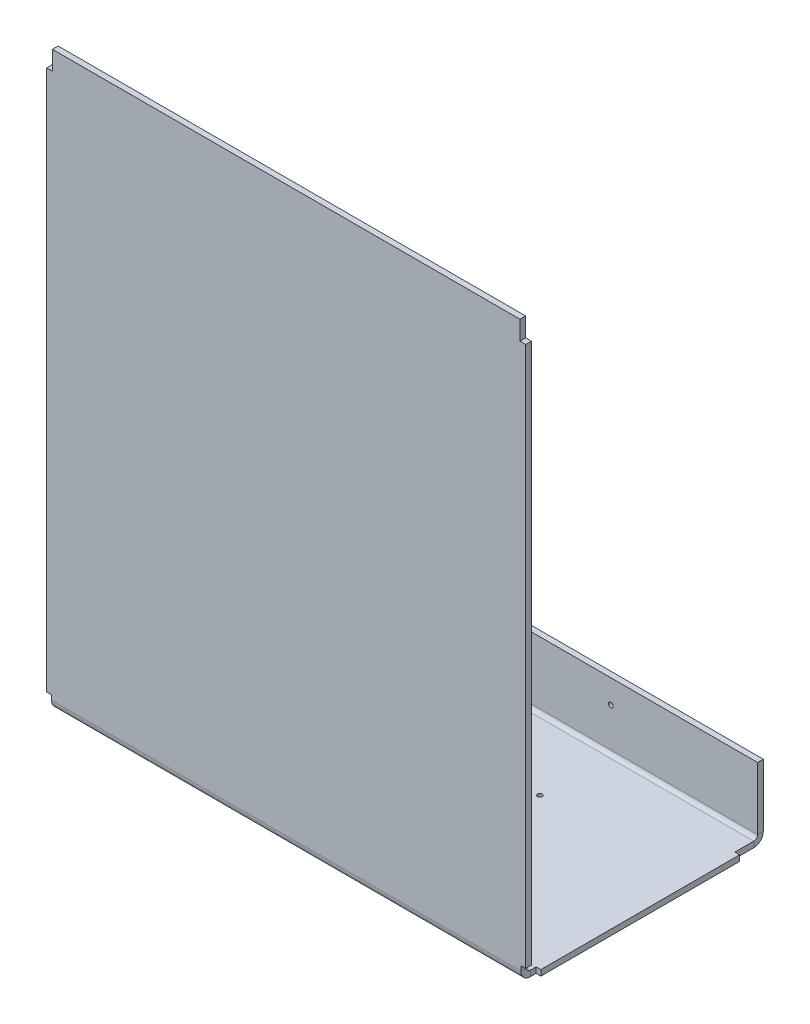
ISO-10303-21;
HEADER;
FILE_DESCRIPTION(('STEP AP214'),'2;1');
FILE_NAME('part.step','',(''),(''),'','','');
FILE_SCHEMA(('AUTOMOTIVE_DESIGN { 1 0 10303 214 1 1 1 1 }'));
ENDSEC;
DATA;
#1=APPLICATION_CONTEXT('core data for automotive mechanical design processes');
#2=APPLICATION_PROTOCOL_DEFINITION('international standard','automotive_design',2000,#1);
#3=PRODUCT_CONTEXT('',#1,'mechanical');
#4=PRODUCT('Part','Part','',(#3));
#5=PRODUCT_RELATED_PRODUCT_CATEGORY('part','',(#4));
#6=PRODUCT_DEFINITION_FORMATION('','',#4);
#7=PRODUCT_DEFINITION_CONTEXT('part definition',#1,'design');
#8=PRODUCT_DEFINITION('design','',#6,#7);
#9=PRODUCT_DEFINITION_SHAPE('','',#8);
#10=(LENGTH_UNIT() NAMED_UNIT(*) SI_UNIT(.MILLI.,.METRE.));
#11=(NAMED_UNIT(*) PLANE_ANGLE_UNIT() SI_UNIT($,.RADIAN.));
#12=(NAMED_UNIT(*) SI_UNIT($,.STERADIAN.) SOLID_ANGLE_UNIT());
#13=UNCERTAINTY_MEASURE_WITH_UNIT(LENGTH_MEASURE(1.E-05),#10,'distance_accuracy_value','');
#14=(GEOMETRIC_REPRESENTATION_CONTEXT(3) GLOBAL_UNCERTAINTY_ASSIGNED_CONTEXT((#13)) GLOBAL_UNIT_ASSIGNED_CONTEXT((#10,
#11,#12)) REPRESENTATION_CONTEXT('',''));
#15=CARTESIAN_POINT('',(0.,0.,0.));
#16=DIRECTION('',(0.,0.,1.));
#17=DIRECTION('',(1.,0.,0.));
#18=AXIS2_PLACEMENT_3D('',#15,#16,#17);
#19=CARTESIAN_POINT('',(501.,6.,0.));
#20=DIRECTION('',(-1.,0.,0.));
#21=DIRECTION('',(0.,0.,1.));
#22=AXIS2_PLACEMENT_3D('',#19,#20,#21);
#23=PLANE('',#22);
#24=DIRECTION('',(0.,1.,0.));
#25=VECTOR('',#24,1.);
#26=CARTESIAN_POINT('',(501.,6.,-4.));
#27=LINE('',#26,#25);
#28=CARTESIAN_POINT('',(501.,0.,-4.));
#29=VERTEX_POINT('',#28);
#30=CARTESIAN_POINT('',(501.,6.,-4.));
#31=VERTEX_POINT('',#30);
#32=EDGE_CURVE('E11',#29,#31,#27,.T.);
#33=ORIENTED_EDGE('',*,*,#32,.F.);
#34=DIRECTION('',(0.,0.,1.));
#35=VECTOR('',#34,1.);
#36=CARTESIAN_POINT('',(501.,0.,0.));
#37=LINE('',#36,#35);
#38=CARTESIAN_POINT('',(501.,0.,-10.));
#39=VERTEX_POINT('',#38);
#40=EDGE_CURVE('E190',#39,#29,#37,.T.);
#41=ORIENTED_EDGE('',*,*,#40,.F.);
#42=DIRECTION('',(0.,1.,0.));
#43=VECTOR('',#42,1.);
#44=CARTESIAN_POINT('',(501.,6.,-10.));
#45=LINE('',#44,#43);
#46=CARTESIAN_POINT('',(501.,6.,-10.));
#47=VERTEX_POINT('',#46);
#48=EDGE_CURVE('E44',#39,#47,#45,.T.);
#49=ORIENTED_EDGE('',*,*,#48,.T.);
#50=DIRECTION('',(0.,0.,1.));
#51=VECTOR('',#50,1.);
#52=CARTESIAN_POINT('',(501.,6.,0.));
#53=LINE('',#52,#51);
#54=EDGE_CURVE('E334',#47,#31,#53,.T.);
#55=ORIENTED_EDGE('',*,*,#54,.T.);
#56=EDGE_LOOP('',(#33,#41,#49,#55));
#57=FACE_BOUND('',#56,.T.);
#58=ADVANCED_FACE('F34',(#57),#23,.F.);
#59=CARTESIAN_POINT('',(0.,6.,-10.0000000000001));
#60=DIRECTION('',(0.,0.,-1.));
#61=DIRECTION('',(-1.,0.,0.));
#62=AXIS2_PLACEMENT_3D('',#59,#60,#61);
#63=PLANE('',#62);
#64=ORIENTED_EDGE('',*,*,#48,.F.);
#65=DIRECTION('',(1.,0.,0.));
#66=VECTOR('',#65,1.);
#67=CARTESIAN_POINT('',(0.,0.,-10.));
#68=LINE('',#67,#66);
#69=CARTESIAN_POINT('',(506.,0.,-10.));
#70=VERTEX_POINT('',#69);
#71=EDGE_CURVE('E240',#70,#39,#68,.F.);
#72=ORIENTED_EDGE('',*,*,#71,.F.);
#73=DIRECTION('',(0.,1.,0.));
#74=VECTOR('',#73,1.);
#75=CARTESIAN_POINT('',(506.,6.,-10.));
#76=LINE('',#75,#74);
#77=CARTESIAN_POINT('',(506.,6.,-10.));
#78=VERTEX_POINT('',#77);
#79=EDGE_CURVE('E327',#70,#78,#76,.T.);
#80=ORIENTED_EDGE('',*,*,#79,.T.);
#81=DIRECTION('',(-1.,0.,0.));
#82=VECTOR('',#81,1.);
#83=CARTESIAN_POINT('',(0.,6.,-10.0000000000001));
#84=LINE('',#83,#82);
#85=EDGE_CURVE('E348',#78,#47,#84,.T.);
#86=ORIENTED_EDGE('',*,*,#85,.T.);
#87=EDGE_LOOP('',(#64,#72,#80,#86));
#88=FACE_BOUND('',#87,.T.);
#89=ADVANCED_FACE('F356',(#88),#63,.F.);
#90=CARTESIAN_POINT('',(506.,6.,0.));
#91=DIRECTION('',(-1.,0.,0.));
#92=DIRECTION('',(0.,0.,1.));
#93=AXIS2_PLACEMENT_3D('',#90,#91,#92);
#94=PLANE('',#93);
#95=ORIENTED_EDGE('',*,*,#79,.F.);
#96=DIRECTION('',(0.,0.,1.));
#97=VECTOR('',#96,1.);
#98=CARTESIAN_POINT('',(506.,0.,0.));
#99=LINE('',#98,#97);
#100=CARTESIAN_POINT('',(506.,0.,-220.));
#101=VERTEX_POINT('',#100);
#102=EDGE_CURVE('E254',#101,#70,#99,.T.);
#103=ORIENTED_EDGE('',*,*,#102,.F.);
#104=DIRECTION('',(0.,1.,0.));
#105=VECTOR('',#104,1.);
#106=CARTESIAN_POINT('',(506.,6.,-220.));
#107=LINE('',#106,#105);
#108=CARTESIAN_POINT('',(506.,6.,-220.));
#109=VERTEX_POINT('',#108);
#110=EDGE_CURVE('E324',#101,#109,#107,.T.);
#111=ORIENTED_EDGE('',*,*,#110,.T.);
#112=DIRECTION('',(0.,0.,1.));
#113=VECTOR('',#112,1.);
#114=CARTESIAN_POINT('',(506.,6.,0.));
#115=LINE('',#114,#113);
#116=EDGE_CURVE('E357',#109,#78,#115,.T.);
#117=ORIENTED_EDGE('',*,*,#116,.T.);
#118=EDGE_LOOP('',(#95,#103,#111,#117));
#119=FACE_BOUND('',#118,.T.);
#120=ADVANCED_FACE('F557',(#119),#94,.F.);
#121=CARTESIAN_POINT('',(526.296742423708,6.00000000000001,-220.));
#122=DIRECTION('',(0.,0.,-1.));
#123=DIRECTION('',(-1.,0.,0.));
#124=AXIS2_PLACEMENT_3D('',#121,#122,#123);
#125=PLANE('',#124);
#126=ORIENTED_EDGE('',*,*,#110,.F.);
#127=DIRECTION('',(1.,0.,0.));
#128=VECTOR('',#127,1.);
#129=CARTESIAN_POINT('',(0.,0.,-220.));
#130=LINE('',#129,#128);
#131=CARTESIAN_POINT('',(501.,0.,-220.));
#132=VERTEX_POINT('',#131);
#133=EDGE_CURVE('E251',#101,#132,#130,.F.);
#134=ORIENTED_EDGE('',*,*,#133,.T.);
#135=DIRECTION('',(0.,1.,0.));
#136=VECTOR('',#135,1.);
#137=CARTESIAN_POINT('',(501.,6.00000000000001,-220.));
#138=LINE('',#137,#136);
#139=CARTESIAN_POINT('',(501.,6.00000000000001,-220.));
#140=VERTEX_POINT('',#139);
#141=EDGE_CURVE('E321',#132,#140,#138,.T.);
#142=ORIENTED_EDGE('',*,*,#141,.T.);
#143=DIRECTION('',(-1.,0.,0.));
#144=VECTOR('',#143,1.);
#145=CARTESIAN_POINT('',(526.296742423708,6.00000000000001,-220.));
#146=LINE('',#145,#144);
#147=EDGE_CURVE('E360',#109,#140,#146,.T.);
#148=ORIENTED_EDGE('',*,*,#147,.F.);
#149=EDGE_LOOP('',(#126,#134,#142,#148));
#150=FACE_BOUND('',#149,.T.);
#151=ADVANCED_FACE('F562',(#150),#125,.T.);
#152=CARTESIAN_POINT('',(501.,6.00000000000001,-220.));
#153=DIRECTION('',(1.,0.,0.));
#154=DIRECTION('',(0.,0.,-1.));
#155=AXIS2_PLACEMENT_3D('',#152,#153,#154);
#156=PLANE('',#155);
#157=ORIENTED_EDGE('',*,*,#141,.F.);
#158=DIRECTION('',(0.,0.,1.));
#159=VECTOR('',#158,1.);
#160=CARTESIAN_POINT('',(501.,0.,0.));
#161=LINE('',#160,#159);
#162=CARTESIAN_POINT('',(501.,0.,-240.));
#163=VERTEX_POINT('',#162);
#164=EDGE_CURVE('E234',#132,#163,#161,.F.);
#165=ORIENTED_EDGE('',*,*,#164,.T.);
#166=DIRECTION('',(0.,1.,0.));
#167=VECTOR('',#166,1.);
#168=CARTESIAN_POINT('',(501.,6.00000000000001,-240.));
#169=LINE('',#168,#167);
#170=CARTESIAN_POINT('',(501.,6.00000000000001,-240.));
#171=VERTEX_POINT('',#170);
#172=EDGE_CURVE('E319',#163,#171,#169,.T.);
#173=ORIENTED_EDGE('',*,*,#172,.T.);
#174=DIRECTION('',(0.,0.,-1.));
#175=VECTOR('',#174,1.);
#176=CARTESIAN_POINT('',(501.,6.00000000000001,-220.));
#177=LINE('',#176,#175);
#178=EDGE_CURVE('E371',#140,#171,#177,.T.);
#179=ORIENTED_EDGE('',*,*,#178,.F.);
#180=EDGE_LOOP('',(#157,#165,#173,#179));
#181=FACE_BOUND('',#180,.T.);
#182=ADVANCED_FACE('F566',(#181),#156,.T.);
#183=CARTESIAN_POINT('',(501.,10.,-240.));
#184=DIRECTION('',(1.,0.,0.));
#185=DIRECTION('',(0.,0.,-1.));
#186=AXIS2_PLACEMENT_3D('',#183,#184,#185);
#187=PLANE('',#186);
#188=ORIENTED_EDGE('',*,*,#172,.F.);
#189=CARTESIAN_POINT('',(501.,10.,-240.));
#190=DIRECTION('',(-1.,0.,0.));
#191=DIRECTION('',(0.,0.,1.));
#192=AXIS2_PLACEMENT_3D('',#189,#190,#191);
#193=CIRCLE('',#192,10.);
#194=CARTESIAN_POINT('',(501.,10.,-250.));
#195=VERTEX_POINT('',#194);
#196=EDGE_CURVE('E236',#163,#195,#193,.F.);
#197=ORIENTED_EDGE('',*,*,#196,.T.);
#198=DIRECTION('',(0.,0.,1.));
#199=VECTOR('',#198,1.);
#200=CARTESIAN_POINT('',(501.,10.,-244.));
#201=LINE('',#200,#199);
#202=CARTESIAN_POINT('',(501.,10.,-244.));
#203=VERTEX_POINT('',#202);
#204=EDGE_CURVE('E316',#195,#203,#201,.T.);
#205=ORIENTED_EDGE('',*,*,#204,.T.);
#206=CARTESIAN_POINT('',(501.,10.,-240.));
#207=DIRECTION('',(-1.,0.,0.));
#208=DIRECTION('',(0.,0.,1.));
#209=AXIS2_PLACEMENT_3D('',#206,#207,#208);
#210=CIRCLE('',#209,4.);
#211=EDGE_CURVE('E439',#171,#203,#210,.F.);
#212=ORIENTED_EDGE('',*,*,#211,.F.);
#213=EDGE_LOOP('',(#188,#197,#205,#212));
#214=FACE_BOUND('',#213,.T.);
#215=ADVANCED_FACE('F460',(#214),#187,.T.);
#216=CARTESIAN_POINT('',(501.,606.001,-244.));
#217=DIRECTION('',(1.,0.,0.));
#218=DIRECTION('',(0.,1.,0.));
#219=AXIS2_PLACEMENT_3D('',#216,#217,#218);
#220=PLANE('',#219);
#221=ORIENTED_EDGE('',*,*,#204,.F.);
#222=DIRECTION('',(0.,1.,0.));
#223=VECTOR('',#222,1.);
#224=CARTESIAN_POINT('',(501.,6.,-250.));
#225=LINE('',#224,#223);
#226=CARTESIAN_POINT('',(501.,76.0000000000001,-250.));
#227=VERTEX_POINT('',#226);
#228=EDGE_CURVE('E218',#195,#227,#225,.T.);
#229=ORIENTED_EDGE('',*,*,#228,.T.);
#230=DIRECTION('',(0.,0.,1.));
#231=VECTOR('',#230,1.);
#232=CARTESIAN_POINT('',(501.,76.0000000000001,-244.));
#233=LINE('',#232,#231);
#234=CARTESIAN_POINT('',(501.,76.0000000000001,-244.));
#235=VERTEX_POINT('',#234);
#236=EDGE_CURVE('E313',#227,#235,#233,.T.);
#237=ORIENTED_EDGE('',*,*,#236,.T.);
#238=DIRECTION('',(0.,1.,0.));
#239=VECTOR('',#238,1.);
#240=CARTESIAN_POINT('',(501.,606.001,-244.));
#241=LINE('',#240,#239);
#242=EDGE_CURVE('E434',#203,#235,#241,.T.);
#243=ORIENTED_EDGE('',*,*,#242,.F.);
#244=EDGE_LOOP('',(#221,#229,#237,#243));
#245=FACE_BOUND('',#244,.T.);
#246=ADVANCED_FACE('F572',(#245),#220,.T.);
#247=CARTESIAN_POINT('',(0.,76.,-244.));
#248=DIRECTION('',(0.,-1.,0.));
#249=DIRECTION('',(1.,0.,0.));
#250=AXIS2_PLACEMENT_3D('',#247,#248,#249);
#251=PLANE('',#250);
#252=ORIENTED_EDGE('',*,*,#236,.F.);
#253=DIRECTION('',(1.,0.,0.));
#254=VECTOR('',#253,1.);
#255=CARTESIAN_POINT('',(0.,76.,-250.));
#256=LINE('',#255,#254);
#257=CARTESIAN_POINT('',(5.00000000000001,76.,-250.));
#258=VERTEX_POINT('',#257);
#259=EDGE_CURVE('E241',#258,#227,#256,.T.);
#260=ORIENTED_EDGE('',*,*,#259,.F.);
#261=DIRECTION('',(0.,0.,1.));
#262=VECTOR('',#261,1.);
#263=CARTESIAN_POINT('',(5.00000000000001,76.,-244.));
#264=LINE('',#263,#262);
#265=CARTESIAN_POINT('',(5.00000000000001,76.,-244.));
#266=VERTEX_POINT('',#265);
#267=EDGE_CURVE('E310',#258,#266,#264,.T.);
#268=ORIENTED_EDGE('',*,*,#267,.T.);
#269=DIRECTION('',(1.,0.,0.));
#270=VECTOR('',#269,1.);
#271=CARTESIAN_POINT('',(0.,76.,-244.));
#272=LINE('',#271,#270);
#273=EDGE_CURVE('E363',#266,#235,#272,.T.);
#274=ORIENTED_EDGE('',*,*,#273,.T.);
#275=EDGE_LOOP('',(#252,#260,#268,#274));
#276=FACE_BOUND('',#275,.T.);
#277=ADVANCED_FACE('F575',(#276),#251,.F.);
#278=CARTESIAN_POINT('',(5.00000000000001,606.001,-244.));
#279=DIRECTION('',(-1.,0.,0.));
#280=DIRECTION('',(0.,-1.,0.));
#281=AXIS2_PLACEMENT_3D('',#278,#279,#280);
#282=PLANE('',#281);
#283=ORIENTED_EDGE('',*,*,#267,.F.);
#284=DIRECTION('',(0.,1.,0.));
#285=VECTOR('',#284,1.);
#286=CARTESIAN_POINT('',(5.00000000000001,6.,-250.));
#287=LINE('',#286,#285);
#288=CARTESIAN_POINT('',(5.00000000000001,10.,-250.));
#289=VERTEX_POINT('',#288);
#290=EDGE_CURVE('E237',#258,#289,#287,.F.);
#291=ORIENTED_EDGE('',*,*,#290,.T.);
#292=DIRECTION('',(0.,0.,1.));
#293=VECTOR('',#292,1.);
#294=CARTESIAN_POINT('',(5.00000000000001,10.,-244.));
#295=LINE('',#294,#293);
#296=CARTESIAN_POINT('',(5.00000000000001,10.,-244.));
#297=VERTEX_POINT('',#296);
#298=EDGE_CURVE('E307',#289,#297,#295,.T.);
#299=ORIENTED_EDGE('',*,*,#298,.T.);
#300=DIRECTION('',(0.,-1.,0.));
#301=VECTOR('',#300,1.);
#302=CARTESIAN_POINT('',(5.00000000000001,606.001,-244.));
#303=LINE('',#302,#301);
#304=EDGE_CURVE('E358',#266,#297,#303,.T.);
#305=ORIENTED_EDGE('',*,*,#304,.F.);
#306=EDGE_LOOP('',(#283,#291,#299,#305));
#307=FACE_BOUND('',#306,.T.);
#308=ADVANCED_FACE('F477',(#307),#282,.T.);
#309=CARTESIAN_POINT('',(5.,10.,-240.));
#310=DIRECTION('',(-1.,0.,0.));
#311=DIRECTION('',(0.,0.,1.));
#312=AXIS2_PLACEMENT_3D('',#309,#310,#311);
#313=PLANE('',#312);
#314=ORIENTED_EDGE('',*,*,#298,.F.);
#315=CARTESIAN_POINT('',(5.00000000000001,10.,-240.));
#316=DIRECTION('',(-1.,0.,0.));
#317=DIRECTION('',(0.,0.,1.));
#318=AXIS2_PLACEMENT_3D('',#315,#316,#317);
#319=CIRCLE('',#318,10.);
#320=CARTESIAN_POINT('',(5.,0.,-240.));
#321=VERTEX_POINT('',#320);
#322=EDGE_CURVE('E182',#289,#321,#319,.T.);
#323=ORIENTED_EDGE('',*,*,#322,.T.);
#324=DIRECTION('',(0.,1.,0.));
#325=VECTOR('',#324,1.);
#326=CARTESIAN_POINT('',(5.,6.00000000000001,-240.));
#327=LINE('',#326,#325);
#328=CARTESIAN_POINT('',(5.,6.00000000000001,-240.));
#329=VERTEX_POINT('',#328);
#330=EDGE_CURVE('E52',#321,#329,#327,.T.);
#331=ORIENTED_EDGE('',*,*,#330,.T.);
#332=CARTESIAN_POINT('',(5.,10.,-240.));
#333=DIRECTION('',(1.,0.,0.));
#334=DIRECTION('',(0.,0.,-1.));
#335=AXIS2_PLACEMENT_3D('',#332,#333,#334);
#336=CIRCLE('',#335,4.);
#337=EDGE_CURVE('E431',#297,#329,#336,.F.);
#338=ORIENTED_EDGE('',*,*,#337,.F.);
#339=EDGE_LOOP('',(#314,#323,#331,#338));
#340=FACE_BOUND('',#339,.T.);
#341=ADVANCED_FACE('F473',(#340),#313,.T.);
#342=CARTESIAN_POINT('',(5.,6.00000000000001,-220.));
#343=DIRECTION('',(-1.,0.,0.));
#344=DIRECTION('',(0.,0.,1.));
#345=AXIS2_PLACEMENT_3D('',#342,#343,#344);
#346=PLANE('',#345);
#347=ORIENTED_EDGE('',*,*,#330,.F.);
#348=DIRECTION('',(0.,0.,1.));
#349=VECTOR('',#348,1.);
#350=CARTESIAN_POINT('',(5.,0.,0.));
#351=LINE('',#350,#349);
#352=CARTESIAN_POINT('',(5.,0.,-220.));
#353=VERTEX_POINT('',#352);
#354=EDGE_CURVE('E231',#321,#353,#351,.T.);
#355=ORIENTED_EDGE('',*,*,#354,.T.);
#356=DIRECTION('',(0.,1.,0.));
#357=VECTOR('',#356,1.);
#358=CARTESIAN_POINT('',(5.,6.00000000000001,-220.));
#359=LINE('',#358,#357);
#360=CARTESIAN_POINT('',(5.,6.00000000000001,-220.));
#361=VERTEX_POINT('',#360);
#362=EDGE_CURVE('E303',#353,#361,#359,.T.);
#363=ORIENTED_EDGE('',*,*,#362,.T.);
#364=DIRECTION('',(0.,0.,1.));
#365=VECTOR('',#364,1.);
#366=CARTESIAN_POINT('',(5.,6.00000000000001,-220.));
#367=LINE('',#366,#365);
#368=EDGE_CURVE('E373',#329,#361,#367,.T.);
#369=ORIENTED_EDGE('',*,*,#368,.F.);
#370=EDGE_LOOP('',(#347,#355,#363,#369));
#371=FACE_BOUND('',#370,.T.);
#372=ADVANCED_FACE('F582',(#371),#346,.T.);
#373=CARTESIAN_POINT('',(-7.33987435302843,6.00000000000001,-220.));
#374=DIRECTION('',(0.,0.,-1.));
#375=DIRECTION('',(-1.,0.,0.));
#376=AXIS2_PLACEMENT_3D('',#373,#374,#375);
#377=PLANE('',#376);
#378=ORIENTED_EDGE('',*,*,#362,.F.);
#379=DIRECTION('',(1.,0.,0.));
#380=VECTOR('',#379,1.);
#381=CARTESIAN_POINT('',(0.,0.,-220.));
#382=LINE('',#381,#380);
#383=CARTESIAN_POINT('',(0.,0.,-220.));
#384=VERTEX_POINT('',#383);
#385=EDGE_CURVE('E228',#353,#384,#382,.F.);
#386=ORIENTED_EDGE('',*,*,#385,.T.);
#387=DIRECTION('',(0.,1.,0.));
#388=VECTOR('',#387,1.);
#389=CARTESIAN_POINT('',(0.,6.,-220.));
#390=LINE('',#389,#388);
#391=CARTESIAN_POINT('',(0.,6.,-220.));
#392=VERTEX_POINT('',#391);
#393=EDGE_CURVE('E300',#384,#392,#390,.T.);
#394=ORIENTED_EDGE('',*,*,#393,.T.);
#395=DIRECTION('',(-1.,0.,0.));
#396=VECTOR('',#395,1.);
#397=CARTESIAN_POINT('',(-7.33987435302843,6.00000000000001,-220.));
#398=LINE('',#397,#396);
#399=EDGE_CURVE('E376',#361,#392,#398,.T.);
#400=ORIENTED_EDGE('',*,*,#399,.F.);
#401=EDGE_LOOP('',(#378,#386,#394,#400));
#402=FACE_BOUND('',#401,.T.);
#403=ADVANCED_FACE('F585',(#402),#377,.T.);
#404=CARTESIAN_POINT('',(0.,6.,0.));
#405=DIRECTION('',(-1.,0.,0.));
#406=DIRECTION('',(0.,0.,1.));
#407=AXIS2_PLACEMENT_3D('',#404,#405,#406);
#408=PLANE('',#407);
#409=ORIENTED_EDGE('',*,*,#393,.F.);
#410=DIRECTION('',(0.,0.,1.));
#411=VECTOR('',#410,1.);
#412=CARTESIAN_POINT('',(0.,0.,0.));
#413=LINE('',#412,#411);
#414=CARTESIAN_POINT('',(0.,0.,-10.));
#415=VERTEX_POINT('',#414);
#416=EDGE_CURVE('E225',#384,#415,#413,.T.);
#417=ORIENTED_EDGE('',*,*,#416,.T.);
#418=DIRECTION('',(0.,1.,0.));
#419=VECTOR('',#418,1.);
#420=CARTESIAN_POINT('',(0.,6.,-10.));
#421=LINE('',#420,#419);
#422=CARTESIAN_POINT('',(0.,6.,-10.));
#423=VERTEX_POINT('',#422);
#424=EDGE_CURVE('E297',#415,#423,#421,.T.);
#425=ORIENTED_EDGE('',*,*,#424,.T.);
#426=DIRECTION('',(0.,0.,1.));
#427=VECTOR('',#426,1.);
#428=CARTESIAN_POINT('',(0.,6.,0.));
#429=LINE('',#428,#427);
#430=EDGE_CURVE('E379',#392,#423,#429,.T.);
#431=ORIENTED_EDGE('',*,*,#430,.F.);
#432=EDGE_LOOP('',(#409,#417,#425,#431));
#433=FACE_BOUND('',#432,.T.);
#434=ADVANCED_FACE('F588',(#433),#408,.T.);
#435=CARTESIAN_POINT('',(0.,6.,-10.));
#436=DIRECTION('',(0.,0.,-1.));
#437=DIRECTION('',(-1.,0.,0.));
#438=AXIS2_PLACEMENT_3D('',#435,#436,#437);
#439=PLANE('',#438);
#440=ORIENTED_EDGE('',*,*,#424,.F.);
#441=DIRECTION('',(1.,0.,0.));
#442=VECTOR('',#441,1.);
#443=CARTESIAN_POINT('',(0.,0.,-10.));
#444=LINE('',#443,#442);
#445=CARTESIAN_POINT('',(5.,0.,-10.));
#446=VERTEX_POINT('',#445);
#447=EDGE_CURVE('E222',#446,#415,#444,.F.);
#448=ORIENTED_EDGE('',*,*,#447,.F.);
#449=DIRECTION('',(0.,1.,0.));
#450=VECTOR('',#449,1.);
#451=CARTESIAN_POINT('',(5.,6.,-10.));
#452=LINE('',#451,#450);
#453=CARTESIAN_POINT('',(5.,6.,-10.));
#454=VERTEX_POINT('',#453);
#455=EDGE_CURVE('E294',#446,#454,#452,.T.);
#456=ORIENTED_EDGE('',*,*,#455,.T.);
#457=DIRECTION('',(-1.,0.,0.));
#458=VECTOR('',#457,1.);
#459=CARTESIAN_POINT('',(0.,6.,-10.));
#460=LINE('',#459,#458);
#461=EDGE_CURVE('E382',#454,#423,#460,.T.);
#462=ORIENTED_EDGE('',*,*,#461,.T.);
#463=EDGE_LOOP('',(#440,#448,#456,#462));
#464=FACE_BOUND('',#463,.T.);
#465=ADVANCED_FACE('F592',(#464),#439,.F.);
#466=CARTESIAN_POINT('',(5.,6.,0.));
#467=DIRECTION('',(1.,0.,0.));
#468=DIRECTION('',(0.,0.,-1.));
#469=AXIS2_PLACEMENT_3D('',#466,#467,#468);
#470=PLANE('',#469);
#471=ORIENTED_EDGE('',*,*,#455,.F.);
#472=DIRECTION('',(0.,0.,1.));
#473=VECTOR('',#472,1.);
#474=CARTESIAN_POINT('',(5.,0.,0.));
#475=LINE('',#474,#473);
#476=CARTESIAN_POINT('',(5.,0.,-4.));
#477=VERTEX_POINT('',#476);
#478=EDGE_CURVE('E219',#477,#446,#475,.F.);
#479=ORIENTED_EDGE('',*,*,#478,.F.);
#480=DIRECTION('',(0.,1.,0.));
#481=VECTOR('',#480,1.);
#482=CARTESIAN_POINT('',(5.,6.,-4.));
#483=LINE('',#482,#481);
#484=CARTESIAN_POINT('',(5.,6.,-4.));
#485=VERTEX_POINT('',#484);
#486=EDGE_CURVE('E291',#477,#485,#483,.T.);
#487=ORIENTED_EDGE('',*,*,#486,.T.);
#488=DIRECTION('',(0.,0.,-1.));
#489=VECTOR('',#488,1.);
#490=CARTESIAN_POINT('',(5.,6.,0.));
#491=LINE('',#490,#489);
#492=EDGE_CURVE('E354',#485,#454,#491,.T.);
#493=ORIENTED_EDGE('',*,*,#492,.T.);
#494=EDGE_LOOP('',(#471,#479,#487,#493));
#495=FACE_BOUND('',#494,.T.);
#496=ADVANCED_FACE('F596',(#495),#470,.F.);
#497=CARTESIAN_POINT('',(5.,10.,-4.));
#498=DIRECTION('',(1.,0.,0.));
#499=DIRECTION('',(0.,0.,-1.));
#500=AXIS2_PLACEMENT_3D('',#497,#498,#499);
#501=PLANE('',#500);
#502=ORIENTED_EDGE('',*,*,#486,.F.);
#503=CARTESIAN_POINT('',(5.,10.,-4.));
#504=DIRECTION('',(1.,0.,0.));
#505=DIRECTION('',(0.,0.,-1.));
#506=AXIS2_PLACEMENT_3D('',#503,#504,#505);
#507=CIRCLE('',#506,10.);
#508=CARTESIAN_POINT('',(5.,10.,6.));
#509=VERTEX_POINT('',#508);
#510=EDGE_CURVE('E181',#477,#509,#507,.F.);
#511=ORIENTED_EDGE('',*,*,#510,.T.);
#512=DIRECTION('',(0.,0.,-1.));
#513=VECTOR('',#512,1.);
#514=CARTESIAN_POINT('',(5.,10.,0.));
#515=LINE('',#514,#513);
#516=CARTESIAN_POINT('',(5.,10.,0.));
#517=VERTEX_POINT('',#516);
#518=EDGE_CURVE('E288',#509,#517,#515,.T.);
#519=ORIENTED_EDGE('',*,*,#518,.T.);
#520=CARTESIAN_POINT('',(5.,10.,-4.));
#521=DIRECTION('',(-1.,0.,0.));
#522=DIRECTION('',(0.,0.,1.));
#523=AXIS2_PLACEMENT_3D('',#520,#521,#522);
#524=CIRCLE('',#523,4.);
#525=EDGE_CURVE('E430',#485,#517,#524,.T.);
#526=ORIENTED_EDGE('',*,*,#525,.F.);
#527=EDGE_LOOP('',(#502,#511,#519,#526));
#528=FACE_BOUND('',#527,.T.);
#529=ADVANCED_FACE('F600',(#528),#501,.F.);
#530=CARTESIAN_POINT('',(5.,586.,0.));
#531=DIRECTION('',(1.,0.,0.));
#532=DIRECTION('',(0.,1.,0.));
#533=AXIS2_PLACEMENT_3D('',#530,#531,#532);
#534=PLANE('',#533);
#535=ORIENTED_EDGE('',*,*,#518,.F.);
#536=DIRECTION('',(0.,1.,0.));
#537=VECTOR('',#536,1.);
#538=CARTESIAN_POINT('',(5.,586.,6.));
#539=LINE('',#538,#537);
#540=CARTESIAN_POINT('',(5.,15.,6.));
#541=VERTEX_POINT('',#540);
#542=EDGE_CURVE('E171',#509,#541,#539,.T.);
#543=ORIENTED_EDGE('',*,*,#542,.T.);
#544=DIRECTION('',(0.,0.,-1.));
#545=VECTOR('',#544,1.);
#546=CARTESIAN_POINT('',(5.,15.,0.));
#547=LINE('',#546,#545);
#548=CARTESIAN_POINT('',(5.,15.,0.));
#549=VERTEX_POINT('',#548);
#550=EDGE_CURVE('E285',#541,#549,#547,.T.);
#551=ORIENTED_EDGE('',*,*,#550,.T.);
#552=DIRECTION('',(0.,1.,0.));
#553=VECTOR('',#552,1.);
#554=CARTESIAN_POINT('',(5.,586.,0.));
#555=LINE('',#554,#553);
#556=EDGE_CURVE('E393',#517,#549,#555,.T.);
#557=ORIENTED_EDGE('',*,*,#556,.F.);
#558=EDGE_LOOP('',(#535,#543,#551,#557));
#559=FACE_BOUND('',#558,.T.);
#560=ADVANCED_FACE('F604',(#559),#534,.F.);
#561=CARTESIAN_POINT('',(0.,15.,0.));
#562=DIRECTION('',(0.,-1.,0.));
#563=DIRECTION('',(1.,0.,0.));
#564=AXIS2_PLACEMENT_3D('',#561,#562,#563);
#565=PLANE('',#564);
#566=ORIENTED_EDGE('',*,*,#550,.F.);
#567=DIRECTION('',(1.,0.,0.));
#568=VECTOR('',#567,1.);
#569=CARTESIAN_POINT('',(0.,15.,6.));
#570=LINE('',#569,#568);
#571=CARTESIAN_POINT('',(0.,15.,6.));
#572=VERTEX_POINT('',#571);
#573=EDGE_CURVE('E188',#572,#541,#570,.T.);
#574=ORIENTED_EDGE('',*,*,#573,.F.);
#575=DIRECTION('',(0.,0.,-1.));
#576=VECTOR('',#575,1.);
#577=CARTESIAN_POINT('',(0.,15.,0.));
#578=LINE('',#577,#576);
#579=CARTESIAN_POINT('',(0.,15.,0.));
#580=VERTEX_POINT('',#579);
#581=EDGE_CURVE('E282',#572,#580,#578,.T.);
#582=ORIENTED_EDGE('',*,*,#581,.T.);
#583=DIRECTION('',(1.,0.,0.));
#584=VECTOR('',#583,1.);
#585=CARTESIAN_POINT('',(0.,15.,0.));
#586=LINE('',#585,#584);
#587=EDGE_CURVE('E396',#580,#549,#586,.T.);
#588=ORIENTED_EDGE('',*,*,#587,.T.);
#589=EDGE_LOOP('',(#566,#574,#582,#588));
#590=FACE_BOUND('',#589,.T.);
#591=ADVANCED_FACE('F608',(#590),#565,.T.);
#592=CARTESIAN_POINT('',(0.,0.,0.));
#593=DIRECTION('',(-1.,0.,0.));
#594=DIRECTION('',(0.,-1.,0.));
#595=AXIS2_PLACEMENT_3D('',#592,#593,#594);
#596=PLANE('',#595);
#597=ORIENTED_EDGE('',*,*,#581,.F.);
#598=DIRECTION('',(0.,1.,0.));
#599=VECTOR('',#598,1.);
#600=CARTESIAN_POINT('',(0.,586.,6.));
#601=LINE('',#600,#599);
#602=CARTESIAN_POINT('',(0.,586.,6.));
#603=VERTEX_POINT('',#602);
#604=EDGE_CURVE('E213',#603,#572,#601,.F.);
#605=ORIENTED_EDGE('',*,*,#604,.F.);
#606=DIRECTION('',(0.,0.,-1.));
#607=VECTOR('',#606,1.);
#608=CARTESIAN_POINT('',(0.,586.,0.));
#609=LINE('',#608,#607);
#610=CARTESIAN_POINT('',(0.,586.,0.));
#611=VERTEX_POINT('',#610);
#612=EDGE_CURVE('E279',#603,#611,#609,.T.);
#613=ORIENTED_EDGE('',*,*,#612,.T.);
#614=DIRECTION('',(0.,-1.,0.));
#615=VECTOR('',#614,1.);
#616=CARTESIAN_POINT('',(0.,0.,0.));
#617=LINE('',#616,#615);
#618=EDGE_CURVE('E399',#611,#580,#617,.T.);
#619=ORIENTED_EDGE('',*,*,#618,.T.);
#620=EDGE_LOOP('',(#597,#605,#613,#619));
#621=FACE_BOUND('',#620,.T.);
#622=ADVANCED_FACE('F612',(#621),#596,.T.);
#623=CARTESIAN_POINT('',(6.,586.,0.));
#624=DIRECTION('',(0.,1.,0.));
#625=DIRECTION('',(-1.,0.,0.));
#626=AXIS2_PLACEMENT_3D('',#623,#624,#625);
#627=PLANE('',#626);
#628=ORIENTED_EDGE('',*,*,#612,.F.);
#629=DIRECTION('',(1.,0.,0.));
#630=VECTOR('',#629,1.);
#631=CARTESIAN_POINT('',(0.,586.,6.));
#632=LINE('',#631,#630);
#633=CARTESIAN_POINT('',(6.,586.,6.));
#634=VERTEX_POINT('',#633);
#635=EDGE_CURVE('E210',#634,#603,#632,.F.);
#636=ORIENTED_EDGE('',*,*,#635,.F.);
#637=DIRECTION('',(0.,0.,-1.));
#638=VECTOR('',#637,1.);
#639=CARTESIAN_POINT('',(6.,586.,0.));
#640=LINE('',#639,#638);
#641=CARTESIAN_POINT('',(6.,586.,0.));
#642=VERTEX_POINT('',#641);
#643=EDGE_CURVE('E276',#634,#642,#640,.T.);
#644=ORIENTED_EDGE('',*,*,#643,.T.);
#645=DIRECTION('',(-1.,0.,0.));
#646=VECTOR('',#645,1.);
#647=CARTESIAN_POINT('',(6.,586.,0.));
#648=LINE('',#647,#646);
#649=EDGE_CURVE('E402',#642,#611,#648,.T.);
#650=ORIENTED_EDGE('',*,*,#649,.T.);
#651=EDGE_LOOP('',(#628,#636,#644,#650));
#652=FACE_BOUND('',#651,.T.);
#653=ADVANCED_FACE('F616',(#652),#627,.T.);
#654=CARTESIAN_POINT('',(5.99999999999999,606.,0.));
#655=DIRECTION('',(-1.,0.,0.));
#656=DIRECTION('',(0.,-1.,0.));
#657=AXIS2_PLACEMENT_3D('',#654,#655,#656);
#658=PLANE('',#657);
#659=ORIENTED_EDGE('',*,*,#643,.F.);
#660=DIRECTION('',(0.,1.,0.));
#661=VECTOR('',#660,1.);
#662=CARTESIAN_POINT('',(5.99999999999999,586.,6.));
#663=LINE('',#662,#661);
#664=CARTESIAN_POINT('',(5.99999999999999,606.,6.));
#665=VERTEX_POINT('',#664);
#666=EDGE_CURVE('E207',#665,#634,#663,.F.);
#667=ORIENTED_EDGE('',*,*,#666,.F.);
#668=DIRECTION('',(0.,0.,-1.));
#669=VECTOR('',#668,1.);
#670=CARTESIAN_POINT('',(5.99999999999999,606.,0.));
#671=LINE('',#670,#669);
#672=CARTESIAN_POINT('',(5.99999999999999,606.,0.));
#673=VERTEX_POINT('',#672);
#674=EDGE_CURVE('E273',#665,#673,#671,.T.);
#675=ORIENTED_EDGE('',*,*,#674,.T.);
#676=DIRECTION('',(0.,-1.,0.));
#677=VECTOR('',#676,1.);
#678=CARTESIAN_POINT('',(5.99999999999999,606.,0.));
#679=LINE('',#678,#677);
#680=EDGE_CURVE('E407',#673,#642,#679,.T.);
#681=ORIENTED_EDGE('',*,*,#680,.T.);
#682=EDGE_LOOP('',(#659,#667,#675,#681));
#683=FACE_BOUND('',#682,.T.);
#684=ADVANCED_FACE('F620',(#683),#658,.T.);
#685=CARTESIAN_POINT('',(5.99999999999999,606.,0.));
#686=DIRECTION('',(0.,1.,0.));
#687=DIRECTION('',(-1.,0.,0.));
#688=AXIS2_PLACEMENT_3D('',#685,#686,#687);
#689=PLANE('',#688);
#690=ORIENTED_EDGE('',*,*,#674,.F.);
#691=DIRECTION('',(1.,0.,0.));
#692=VECTOR('',#691,1.);
#693=CARTESIAN_POINT('',(0.,606.,6.));
#694=LINE('',#693,#692);
#695=CARTESIAN_POINT('',(500.,606.,6.));
#696=VERTEX_POINT('',#695);
#697=EDGE_CURVE('E204',#696,#665,#694,.F.);
#698=ORIENTED_EDGE('',*,*,#697,.F.);
#699=DIRECTION('',(0.,0.,-1.));
#700=VECTOR('',#699,1.);
#701=CARTESIAN_POINT('',(500.,606.,0.));
#702=LINE('',#701,#700);
#703=CARTESIAN_POINT('',(500.,606.,0.));
#704=VERTEX_POINT('',#703);
#705=EDGE_CURVE('E270',#696,#704,#702,.T.);
#706=ORIENTED_EDGE('',*,*,#705,.T.);
#707=DIRECTION('',(-1.,0.,0.));
#708=VECTOR('',#707,1.);
#709=CARTESIAN_POINT('',(5.99999999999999,606.,0.));
#710=LINE('',#709,#708);
#711=EDGE_CURVE('E410',#704,#673,#710,.T.);
#712=ORIENTED_EDGE('',*,*,#711,.T.);
#713=EDGE_LOOP('',(#690,#698,#706,#712));
#714=FACE_BOUND('',#713,.T.);
#715=ADVANCED_FACE('F624',(#714),#689,.T.);
#716=CARTESIAN_POINT('',(500.,606.,0.));
#717=DIRECTION('',(1.,0.,0.));
#718=DIRECTION('',(0.,1.,0.));
#719=AXIS2_PLACEMENT_3D('',#716,#717,#718);
#720=PLANE('',#719);
#721=ORIENTED_EDGE('',*,*,#705,.F.);
#722=DIRECTION('',(0.,1.,0.));
#723=VECTOR('',#722,1.);
#724=CARTESIAN_POINT('',(500.,586.,6.));
#725=LINE('',#724,#723);
#726=CARTESIAN_POINT('',(500.,586.,6.));
#727=VERTEX_POINT('',#726);
#728=EDGE_CURVE('E201',#727,#696,#725,.T.);
#729=ORIENTED_EDGE('',*,*,#728,.F.);
#730=DIRECTION('',(0.,0.,-1.));
#731=VECTOR('',#730,1.);
#732=CARTESIAN_POINT('',(500.,586.,0.));
#733=LINE('',#732,#731);
#734=CARTESIAN_POINT('',(500.,586.,0.));
#735=VERTEX_POINT('',#734);
#736=EDGE_CURVE('E267',#727,#735,#733,.T.);
#737=ORIENTED_EDGE('',*,*,#736,.T.);
#738=DIRECTION('',(0.,1.,0.));
#739=VECTOR('',#738,1.);
#740=CARTESIAN_POINT('',(500.,606.,0.));
#741=LINE('',#740,#739);
#742=EDGE_CURVE('E413',#735,#704,#741,.T.);
#743=ORIENTED_EDGE('',*,*,#742,.T.);
#744=EDGE_LOOP('',(#721,#729,#737,#743));
#745=FACE_BOUND('',#744,.T.);
#746=ADVANCED_FACE('F628',(#745),#720,.T.);
#747=CARTESIAN_POINT('',(500.,586.,0.));
#748=DIRECTION('',(0.,1.,0.));
#749=DIRECTION('',(-1.,0.,0.));
#750=AXIS2_PLACEMENT_3D('',#747,#748,#749);
#751=PLANE('',#750);
#752=ORIENTED_EDGE('',*,*,#736,.F.);
#753=DIRECTION('',(1.,0.,0.));
#754=VECTOR('',#753,1.);
#755=CARTESIAN_POINT('',(0.,586.,6.));
#756=LINE('',#755,#754);
#757=CARTESIAN_POINT('',(506.,586.,6.));
#758=VERTEX_POINT('',#757);
#759=EDGE_CURVE('E198',#758,#727,#756,.F.);
#760=ORIENTED_EDGE('',*,*,#759,.F.);
#761=DIRECTION('',(0.,0.,-1.));
#762=VECTOR('',#761,1.);
#763=CARTESIAN_POINT('',(506.,586.,0.));
#764=LINE('',#763,#762);
#765=CARTESIAN_POINT('',(506.,586.,0.));
#766=VERTEX_POINT('',#765);
#767=EDGE_CURVE('E264',#758,#766,#764,.T.);
#768=ORIENTED_EDGE('',*,*,#767,.T.);
#769=DIRECTION('',(-1.,0.,0.));
#770=VECTOR('',#769,1.);
#771=CARTESIAN_POINT('',(500.,586.,0.));
#772=LINE('',#771,#770);
#773=EDGE_CURVE('E416',#766,#735,#772,.T.);
#774=ORIENTED_EDGE('',*,*,#773,.T.);
#775=EDGE_LOOP('',(#752,#760,#768,#774));
#776=FACE_BOUND('',#775,.T.);
#777=ADVANCED_FACE('F632',(#776),#751,.T.);
#778=CARTESIAN_POINT('',(506.,0.,0.));
#779=DIRECTION('',(1.,0.,0.));
#780=DIRECTION('',(0.,1.,0.));
#781=AXIS2_PLACEMENT_3D('',#778,#779,#780);
#782=PLANE('',#781);
#783=ORIENTED_EDGE('',*,*,#767,.F.);
#784=DIRECTION('',(0.,1.,0.));
#785=VECTOR('',#784,1.);
#786=CARTESIAN_POINT('',(506.,586.,6.));
#787=LINE('',#786,#785);
#788=CARTESIAN_POINT('',(506.,15.,6.));
#789=VERTEX_POINT('',#788);
#790=EDGE_CURVE('E195',#789,#758,#787,.T.);
#791=ORIENTED_EDGE('',*,*,#790,.F.);
#792=DIRECTION('',(0.,0.,-1.));
#793=VECTOR('',#792,1.);
#794=CARTESIAN_POINT('',(506.,15.,0.));
#795=LINE('',#794,#793);
#796=CARTESIAN_POINT('',(506.,15.,0.));
#797=VERTEX_POINT('',#796);
#798=EDGE_CURVE('E261',#789,#797,#795,.T.);
#799=ORIENTED_EDGE('',*,*,#798,.T.);
#800=DIRECTION('',(0.,1.,0.));
#801=VECTOR('',#800,1.);
#802=CARTESIAN_POINT('',(506.,0.,0.));
#803=LINE('',#802,#801);
#804=EDGE_CURVE('E419',#797,#766,#803,.T.);
#805=ORIENTED_EDGE('',*,*,#804,.T.);
#806=EDGE_LOOP('',(#783,#791,#799,#805));
#807=FACE_BOUND('',#806,.T.);
#808=ADVANCED_FACE('F636',(#807),#782,.T.);
#809=CARTESIAN_POINT('',(0.,15.,0.));
#810=DIRECTION('',(0.,1.,0.));
#811=DIRECTION('',(-1.,0.,0.));
#812=AXIS2_PLACEMENT_3D('',#809,#810,#811);
#813=PLANE('',#812);
#814=ORIENTED_EDGE('',*,*,#798,.F.);
#815=DIRECTION('',(1.,0.,0.));
#816=VECTOR('',#815,1.);
#817=CARTESIAN_POINT('',(0.,15.,6.));
#818=LINE('',#817,#816);
#819=CARTESIAN_POINT('',(501.,15.,6.));
#820=VERTEX_POINT('',#819);
#821=EDGE_CURVE('E186',#789,#820,#818,.F.);
#822=ORIENTED_EDGE('',*,*,#821,.T.);
#823=DIRECTION('',(0.,0.,-1.));
#824=VECTOR('',#823,1.);
#825=CARTESIAN_POINT('',(501.,15.,0.));
#826=LINE('',#825,#824);
#827=CARTESIAN_POINT('',(501.,15.,0.));
#828=VERTEX_POINT('',#827);
#829=EDGE_CURVE('E158',#820,#828,#826,.T.);
#830=ORIENTED_EDGE('',*,*,#829,.T.);
#831=DIRECTION('',(-1.,0.,0.));
#832=VECTOR('',#831,1.);
#833=CARTESIAN_POINT('',(0.,15.,0.));
#834=LINE('',#833,#832);
#835=EDGE_CURVE('E353',#797,#828,#834,.T.);
#836=ORIENTED_EDGE('',*,*,#835,.F.);
#837=EDGE_LOOP('',(#814,#822,#830,#836));
#838=FACE_BOUND('',#837,.T.);
#839=ADVANCED_FACE('F640',(#838),#813,.F.);
#840=CARTESIAN_POINT('',(501.,586.,0.));
#841=DIRECTION('',(-1.,0.,0.));
#842=DIRECTION('',(0.,-1.,0.));
#843=AXIS2_PLACEMENT_3D('',#840,#841,#842);
#844=PLANE('',#843);
#845=ORIENTED_EDGE('',*,*,#829,.F.);
#846=DIRECTION('',(0.,1.,0.));
#847=VECTOR('',#846,1.);
#848=CARTESIAN_POINT('',(501.,586.,6.));
#849=LINE('',#848,#847);
#850=CARTESIAN_POINT('',(501.,10.,6.));
#851=VERTEX_POINT('',#850);
#852=EDGE_CURVE('E167',#820,#851,#849,.F.);
#853=ORIENTED_EDGE('',*,*,#852,.T.);
#854=DIRECTION('',(0.,0.,-1.));
#855=VECTOR('',#854,1.);
#856=CARTESIAN_POINT('',(501.,10.,0.));
#857=LINE('',#856,#855);
#858=CARTESIAN_POINT('',(501.,10.,0.));
#859=VERTEX_POINT('',#858);
#860=EDGE_CURVE('E38',#851,#859,#857,.T.);
#861=ORIENTED_EDGE('',*,*,#860,.T.);
#862=DIRECTION('',(0.,-1.,0.));
#863=VECTOR('',#862,1.);
#864=CARTESIAN_POINT('',(501.,586.,0.));
#865=LINE('',#864,#863);
#866=EDGE_CURVE('E391',#828,#859,#865,.T.);
#867=ORIENTED_EDGE('',*,*,#866,.F.);
#868=EDGE_LOOP('',(#845,#853,#861,#867));
#869=FACE_BOUND('',#868,.T.);
#870=ADVANCED_FACE('F184',(#869),#844,.F.);
#871=CARTESIAN_POINT('',(501.,10.,-4.));
#872=DIRECTION('',(-1.,0.,0.));
#873=DIRECTION('',(0.,0.,1.));
#874=AXIS2_PLACEMENT_3D('',#871,#872,#873);
#875=PLANE('',#874);
#876=CARTESIAN_POINT('',(501.,10.,-4.));
#877=DIRECTION('',(1.,0.,0.));
#878=DIRECTION('',(0.,0.,-1.));
#879=AXIS2_PLACEMENT_3D('',#876,#877,#878);
#880=CIRCLE('',#879,10.);
#881=EDGE_CURVE('E149',#851,#29,#880,.T.);
#882=ORIENTED_EDGE('',*,*,#881,.T.);
#883=ORIENTED_EDGE('',*,*,#32,.T.);
#884=CARTESIAN_POINT('',(501.,10.,-4.));
#885=DIRECTION('',(1.,0.,0.));
#886=DIRECTION('',(0.,0.,-1.));
#887=AXIS2_PLACEMENT_3D('',#884,#885,#886);
#888=CIRCLE('',#887,4.);
#889=EDGE_CURVE('E152',#859,#31,#888,.T.);
#890=ORIENTED_EDGE('',*,*,#889,.F.);
#891=ORIENTED_EDGE('',*,*,#860,.F.);
#892=EDGE_LOOP('',(#882,#883,#890,#891));
#893=FACE_BOUND('',#892,.T.);
#894=ADVANCED_FACE('F36',(#893),#875,.F.);
#895=CARTESIAN_POINT('',(0.,586.,0.));
#896=DIRECTION('',(0.,0.,1.));
#897=DIRECTION('',(1.,0.,0.));
#898=AXIS2_PLACEMENT_3D('',#895,#896,#897);
#899=PLANE('',#898);
#900=ORIENTED_EDGE('',*,*,#866,.T.);
#901=DIRECTION('',(1.,0.,0.));
#902=VECTOR('',#901,1.);
#903=CARTESIAN_POINT('',(0.,10.,0.));
#904=LINE('',#903,#902);
#905=EDGE_CURVE('E425',#859,#517,#904,.F.);
#906=ORIENTED_EDGE('',*,*,#905,.T.);
#907=ORIENTED_EDGE('',*,*,#556,.T.);
#908=ORIENTED_EDGE('',*,*,#587,.F.);
#909=ORIENTED_EDGE('',*,*,#618,.F.);
#910=ORIENTED_EDGE('',*,*,#649,.F.);
#911=ORIENTED_EDGE('',*,*,#680,.F.);
#912=ORIENTED_EDGE('',*,*,#711,.F.);
#913=ORIENTED_EDGE('',*,*,#742,.F.);
#914=ORIENTED_EDGE('',*,*,#773,.F.);
#915=ORIENTED_EDGE('',*,*,#804,.F.);
#916=ORIENTED_EDGE('',*,*,#835,.T.);
#917=EDGE_LOOP('',(#900,#906,#907,#908,#909,#910,#911,#912,#913,#914,#915,#916));
#918=FACE_BOUND('',#917,.T.);
#919=ADVANCED_FACE('F647',(#918),#899,.F.);
#920=CARTESIAN_POINT('',(0.,6.,0.));
#921=DIRECTION('',(0.,1.,0.));
#922=DIRECTION('',(0.,0.,1.));
#923=AXIS2_PLACEMENT_3D('',#920,#921,#922);
#924=PLANE('',#923);
#925=CARTESIAN_POINT('',(146.,6.,-169.));
#926=DIRECTION('',(0.,1.,0.));
#927=DIRECTION('',(0.,0.,1.));
#928=AXIS2_PLACEMENT_3D('',#925,#926,#927);
#929=CIRCLE('',#928,2.5);
#930=CARTESIAN_POINT('',(146.,6.,-166.5));
#931=VERTEX_POINT('',#930);
#932=EDGE_CURVE('E509',#931,#931,#929,.T.);
#933=ORIENTED_EDGE('',*,*,#932,.F.);
#934=EDGE_LOOP('',(#933));
#935=FACE_BOUND('',#934,.T.);
#936=CARTESIAN_POINT('',(346.,6.,-169.));
#937=DIRECTION('',(0.,1.,0.));
#938=DIRECTION('',(0.,0.,1.));
#939=AXIS2_PLACEMENT_3D('',#936,#937,#938);
#940=CIRCLE('',#939,2.50000000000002);
#941=CARTESIAN_POINT('',(346.,6.,-166.5));
#942=VERTEX_POINT('',#941);
#943=EDGE_CURVE('E503',#942,#942,#940,.T.);
#944=ORIENTED_EDGE('',*,*,#943,.F.);
#945=EDGE_LOOP('',(#944));
#946=FACE_BOUND('',#945,.T.);
#947=CARTESIAN_POINT('',(250.,6.,-130.));
#948=DIRECTION('',(0.,1.,0.));
#949=DIRECTION('',(0.,0.,1.));
#950=AXIS2_PLACEMENT_3D('',#947,#948,#949);
#951=CIRCLE('',#950,2.50000000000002);
#952=CARTESIAN_POINT('',(250.,6.,-127.5));
#953=VERTEX_POINT('',#952);
#954=EDGE_CURVE('E497',#953,#953,#951,.T.);
#955=ORIENTED_EDGE('',*,*,#954,.F.);
#956=EDGE_LOOP('',(#955));
#957=FACE_BOUND('',#956,.T.);
#958=CARTESIAN_POINT('',(250.,6.,-25.));
#959=DIRECTION('',(0.,1.,0.));
#960=DIRECTION('',(0.,0.,1.));
#961=AXIS2_PLACEMENT_3D('',#958,#959,#960);
#962=CIRCLE('',#961,2.50000000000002);
#963=CARTESIAN_POINT('',(250.,6.,-22.5));
#964=VERTEX_POINT('',#963);
#965=EDGE_CURVE('E491',#964,#964,#962,.T.);
#966=ORIENTED_EDGE('',*,*,#965,.F.);
#967=EDGE_LOOP('',(#966));
#968=FACE_BOUND('',#967,.T.);
#969=ORIENTED_EDGE('',*,*,#178,.T.);
#970=DIRECTION('',(1.,0.,0.));
#971=VECTOR('',#970,1.);
#972=CARTESIAN_POINT('',(5.00000000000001,6.,-240.));
#973=LINE('',#972,#971);
#974=EDGE_CURVE('E159',#171,#329,#973,.F.);
#975=ORIENTED_EDGE('',*,*,#974,.T.);
#976=ORIENTED_EDGE('',*,*,#368,.T.);
#977=ORIENTED_EDGE('',*,*,#399,.T.);
#978=ORIENTED_EDGE('',*,*,#430,.T.);
#979=ORIENTED_EDGE('',*,*,#461,.F.);
#980=ORIENTED_EDGE('',*,*,#492,.F.);
#981=DIRECTION('',(1.,0.,0.));
#982=VECTOR('',#981,1.);
#983=CARTESIAN_POINT('',(0.,6.,-4.));
#984=LINE('',#983,#982);
#985=EDGE_CURVE('E352',#485,#31,#984,.T.);
#986=ORIENTED_EDGE('',*,*,#985,.T.);
#987=ORIENTED_EDGE('',*,*,#54,.F.);
#988=ORIENTED_EDGE('',*,*,#85,.F.);
#989=ORIENTED_EDGE('',*,*,#116,.F.);
#990=ORIENTED_EDGE('',*,*,#147,.T.);
#991=EDGE_LOOP('',(#969,#975,#976,#977,#978,#979,#980,#986,#987,#988,#989,#990));
#992=FACE_BOUND('',#991,.T.);
#993=ADVANCED_FACE('F345',(#935,#946,#957,#968,#992),#924,.T.);
#994=CARTESIAN_POINT('',(0.,6.,-244.));
#995=DIRECTION('',(0.,0.,1.));
#996=DIRECTION('',(1.,0.,0.));
#997=AXIS2_PLACEMENT_3D('',#994,#995,#996);
#998=PLANE('',#997);
#999=CARTESIAN_POINT('',(346.,51.,-244.));
#1000=DIRECTION('',(0.,0.,1.));
#1001=DIRECTION('',(1.,0.,0.));
#1002=AXIS2_PLACEMENT_3D('',#999,#1000,#1001);
#1003=CIRCLE('',#1002,2.50000000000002);
#1004=CARTESIAN_POINT('',(348.5,51.,-244.));
#1005=VERTEX_POINT('',#1004);
#1006=EDGE_CURVE('E521',#1005,#1005,#1003,.T.);
#1007=ORIENTED_EDGE('',*,*,#1006,.F.);
#1008=EDGE_LOOP('',(#1007));
#1009=FACE_BOUND('',#1008,.T.);
#1010=CARTESIAN_POINT('',(146.,51.,-244.));
#1011=DIRECTION('',(0.,0.,1.));
#1012=DIRECTION('',(1.,0.,0.));
#1013=AXIS2_PLACEMENT_3D('',#1010,#1011,#1012);
#1014=CIRCLE('',#1013,2.5);
#1015=CARTESIAN_POINT('',(148.5,51.,-244.));
#1016=VERTEX_POINT('',#1015);
#1017=EDGE_CURVE('E515',#1016,#1016,#1014,.T.);
#1018=ORIENTED_EDGE('',*,*,#1017,.F.);
#1019=EDGE_LOOP('',(#1018));
#1020=FACE_BOUND('',#1019,.T.);
#1021=ORIENTED_EDGE('',*,*,#304,.T.);
#1022=DIRECTION('',(1.,0.,0.));
#1023=VECTOR('',#1022,1.);
#1024=CARTESIAN_POINT('',(501.,10.,-244.));
#1025=LINE('',#1024,#1023);
#1026=EDGE_CURVE('E428',#297,#203,#1025,.T.);
#1027=ORIENTED_EDGE('',*,*,#1026,.T.);
#1028=ORIENTED_EDGE('',*,*,#242,.T.);
#1029=ORIENTED_EDGE('',*,*,#273,.F.);
#1030=EDGE_LOOP('',(#1021,#1027,#1028,#1029));
#1031=FACE_BOUND('',#1030,.T.);
#1032=ADVANCED_FACE('F481',(#1009,#1020,#1031),#998,.T.);
#1033=CARTESIAN_POINT('',(0.,10.,-4.));
#1034=DIRECTION('',(1.,0.,0.));
#1035=DIRECTION('',(0.,0.,-1.));
#1036=AXIS2_PLACEMENT_3D('',#1033,#1034,#1035);
#1037=CYLINDRICAL_SURFACE('',#1036,4.);
#1038=ORIENTED_EDGE('',*,*,#525,.T.);
#1039=ORIENTED_EDGE('',*,*,#905,.F.);
#1040=ORIENTED_EDGE('',*,*,#889,.T.);
#1041=ORIENTED_EDGE('',*,*,#985,.F.);
#1042=EDGE_LOOP('',(#1038,#1039,#1040,#1041));
#1043=FACE_BOUND('',#1042,.T.);
#1044=ADVANCED_FACE('F530',(#1043),#1037,.F.);
#1045=CARTESIAN_POINT('',(0.,10.,-240.));
#1046=DIRECTION('',(-1.,0.,0.));
#1047=DIRECTION('',(0.,0.,1.));
#1048=AXIS2_PLACEMENT_3D('',#1045,#1046,#1047);
#1049=CYLINDRICAL_SURFACE('',#1048,4.);
#1050=ORIENTED_EDGE('',*,*,#337,.T.);
#1051=ORIENTED_EDGE('',*,*,#974,.F.);
#1052=ORIENTED_EDGE('',*,*,#211,.T.);
#1053=ORIENTED_EDGE('',*,*,#1026,.F.);
#1054=EDGE_LOOP('',(#1050,#1051,#1052,#1053));
#1055=FACE_BOUND('',#1054,.T.);
#1056=ADVANCED_FACE('F673',(#1055),#1049,.F.);
#1057=CARTESIAN_POINT('',(0.,586.,6.));
#1058=DIRECTION('',(0.,0.,1.));
#1059=DIRECTION('',(1.,0.,0.));
#1060=AXIS2_PLACEMENT_3D('',#1057,#1058,#1059);
#1061=PLANE('',#1060);
#1062=ORIENTED_EDGE('',*,*,#852,.F.);
#1063=ORIENTED_EDGE('',*,*,#821,.F.);
#1064=ORIENTED_EDGE('',*,*,#790,.T.);
#1065=ORIENTED_EDGE('',*,*,#759,.T.);
#1066=ORIENTED_EDGE('',*,*,#728,.T.);
#1067=ORIENTED_EDGE('',*,*,#697,.T.);
#1068=ORIENTED_EDGE('',*,*,#666,.T.);
#1069=ORIENTED_EDGE('',*,*,#635,.T.);
#1070=ORIENTED_EDGE('',*,*,#604,.T.);
#1071=ORIENTED_EDGE('',*,*,#573,.T.);
#1072=ORIENTED_EDGE('',*,*,#542,.F.);
#1073=DIRECTION('',(1.,0.,0.));
#1074=VECTOR('',#1073,1.);
#1075=CARTESIAN_POINT('',(0.,10.,6.));
#1076=LINE('',#1075,#1074);
#1077=EDGE_CURVE('E164',#851,#509,#1076,.F.);
#1078=ORIENTED_EDGE('',*,*,#1077,.F.);
#1079=EDGE_LOOP('',(#1062,#1063,#1064,#1065,#1066,#1067,#1068,#1069,#1070,#1071,#1072,#1078));
#1080=FACE_BOUND('',#1079,.T.);
#1081=ADVANCED_FACE('F165',(#1080),#1061,.T.);
#1082=CARTESIAN_POINT('',(0.,0.,0.));
#1083=DIRECTION('',(0.,1.,0.));
#1084=DIRECTION('',(0.,0.,1.));
#1085=AXIS2_PLACEMENT_3D('',#1082,#1083,#1084);
#1086=PLANE('',#1085);
#1087=CARTESIAN_POINT('',(146.,0.,-169.));
#1088=DIRECTION('',(0.,1.,0.));
#1089=DIRECTION('',(0.,0.,1.));
#1090=AXIS2_PLACEMENT_3D('',#1087,#1088,#1089);
#1091=CIRCLE('',#1090,2.5);
#1092=CARTESIAN_POINT('',(146.,0.,-166.5));
#1093=VERTEX_POINT('',#1092);
#1094=EDGE_CURVE('E506',#1093,#1093,#1091,.F.);
#1095=ORIENTED_EDGE('',*,*,#1094,.F.);
#1096=EDGE_LOOP('',(#1095));
#1097=FACE_BOUND('',#1096,.T.);
#1098=CARTESIAN_POINT('',(346.,0.,-169.));
#1099=DIRECTION('',(0.,1.,0.));
#1100=DIRECTION('',(0.,0.,1.));
#1101=AXIS2_PLACEMENT_3D('',#1098,#1099,#1100);
#1102=CIRCLE('',#1101,2.50000000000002);
#1103=CARTESIAN_POINT('',(346.,0.,-166.5));
#1104=VERTEX_POINT('',#1103);
#1105=EDGE_CURVE('E500',#1104,#1104,#1102,.F.);
#1106=ORIENTED_EDGE('',*,*,#1105,.F.);
#1107=EDGE_LOOP('',(#1106));
#1108=FACE_BOUND('',#1107,.T.);
#1109=CARTESIAN_POINT('',(250.,0.,-130.));
#1110=DIRECTION('',(0.,1.,0.));
#1111=DIRECTION('',(0.,0.,1.));
#1112=AXIS2_PLACEMENT_3D('',#1109,#1110,#1111);
#1113=CIRCLE('',#1112,2.50000000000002);
#1114=CARTESIAN_POINT('',(250.,0.,-127.5));
#1115=VERTEX_POINT('',#1114);
#1116=EDGE_CURVE('E494',#1115,#1115,#1113,.F.);
#1117=ORIENTED_EDGE('',*,*,#1116,.F.);
#1118=EDGE_LOOP('',(#1117));
#1119=FACE_BOUND('',#1118,.T.);
#1120=CARTESIAN_POINT('',(250.,0.,-25.));
#1121=DIRECTION('',(0.,1.,0.));
#1122=DIRECTION('',(0.,0.,1.));
#1123=AXIS2_PLACEMENT_3D('',#1120,#1121,#1122);
#1124=CIRCLE('',#1123,2.50000000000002);
#1125=CARTESIAN_POINT('',(250.,0.,-22.5));
#1126=VERTEX_POINT('',#1125);
#1127=EDGE_CURVE('E248',#1126,#1126,#1124,.F.);
#1128=ORIENTED_EDGE('',*,*,#1127,.F.);
#1129=EDGE_LOOP('',(#1128));
#1130=FACE_BOUND('',#1129,.T.);
#1131=ORIENTED_EDGE('',*,*,#164,.F.);
#1132=ORIENTED_EDGE('',*,*,#133,.F.);
#1133=ORIENTED_EDGE('',*,*,#102,.T.);
#1134=ORIENTED_EDGE('',*,*,#71,.T.);
#1135=ORIENTED_EDGE('',*,*,#40,.T.);
#1136=DIRECTION('',(1.,0.,0.));
#1137=VECTOR('',#1136,1.);
#1138=CARTESIAN_POINT('',(0.,0.,-4.));
#1139=LINE('',#1138,#1137);
#1140=EDGE_CURVE('E176',#477,#29,#1139,.T.);
#1141=ORIENTED_EDGE('',*,*,#1140,.F.);
#1142=ORIENTED_EDGE('',*,*,#478,.T.);
#1143=ORIENTED_EDGE('',*,*,#447,.T.);
#1144=ORIENTED_EDGE('',*,*,#416,.F.);
#1145=ORIENTED_EDGE('',*,*,#385,.F.);
#1146=ORIENTED_EDGE('',*,*,#354,.F.);
#1147=DIRECTION('',(1.,0.,0.));
#1148=VECTOR('',#1147,1.);
#1149=CARTESIAN_POINT('',(0.,0.,-240.));
#1150=LINE('',#1149,#1148);
#1151=EDGE_CURVE('E442',#163,#321,#1150,.F.);
#1152=ORIENTED_EDGE('',*,*,#1151,.F.);
#1153=EDGE_LOOP('',(#1131,#1132,#1133,#1134,#1135,#1141,#1142,#1143,#1144,#1145,#1146,#1152));
#1154=FACE_BOUND('',#1153,.T.);
#1155=ADVANCED_FACE('F468',(#1097,#1108,#1119,#1130,#1154),#1086,.F.);
#1156=CARTESIAN_POINT('',(0.,6.,-250.));
#1157=DIRECTION('',(0.,0.,1.));
#1158=DIRECTION('',(1.,0.,0.));
#1159=AXIS2_PLACEMENT_3D('',#1156,#1157,#1158);
#1160=PLANE('',#1159);
#1161=CARTESIAN_POINT('',(346.,51.,-250.));
#1162=DIRECTION('',(0.,0.,1.));
#1163=DIRECTION('',(1.,0.,0.));
#1164=AXIS2_PLACEMENT_3D('',#1161,#1162,#1163);
#1165=CIRCLE('',#1164,2.50000000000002);
#1166=CARTESIAN_POINT('',(348.5,51.,-250.));
#1167=VERTEX_POINT('',#1166);
#1168=EDGE_CURVE('E518',#1167,#1167,#1165,.F.);
#1169=ORIENTED_EDGE('',*,*,#1168,.F.);
#1170=EDGE_LOOP('',(#1169));
#1171=FACE_BOUND('',#1170,.T.);
#1172=CARTESIAN_POINT('',(146.,51.,-250.));
#1173=DIRECTION('',(0.,0.,1.));
#1174=DIRECTION('',(1.,0.,0.));
#1175=AXIS2_PLACEMENT_3D('',#1172,#1173,#1174);
#1176=CIRCLE('',#1175,2.5);
#1177=CARTESIAN_POINT('',(148.5,51.,-250.));
#1178=VERTEX_POINT('',#1177);
#1179=EDGE_CURVE('E512',#1178,#1178,#1176,.F.);
#1180=ORIENTED_EDGE('',*,*,#1179,.F.);
#1181=EDGE_LOOP('',(#1180));
#1182=FACE_BOUND('',#1181,.T.);
#1183=ORIENTED_EDGE('',*,*,#290,.F.);
#1184=ORIENTED_EDGE('',*,*,#259,.T.);
#1185=ORIENTED_EDGE('',*,*,#228,.F.);
#1186=DIRECTION('',(1.,0.,0.));
#1187=VECTOR('',#1186,1.);
#1188=CARTESIAN_POINT('',(0.,10.,-250.));
#1189=LINE('',#1188,#1187);
#1190=EDGE_CURVE('E175',#289,#195,#1189,.T.);
#1191=ORIENTED_EDGE('',*,*,#1190,.F.);
#1192=EDGE_LOOP('',(#1183,#1184,#1185,#1191));
#1193=FACE_BOUND('',#1192,.T.);
#1194=ADVANCED_FACE('F456',(#1171,#1182,#1193),#1160,.F.);
#1195=CARTESIAN_POINT('',(0.,10.,-4.));
#1196=DIRECTION('',(1.,0.,0.));
#1197=DIRECTION('',(0.,0.,-1.));
#1198=AXIS2_PLACEMENT_3D('',#1195,#1196,#1197);
#1199=CYLINDRICAL_SURFACE('',#1198,10.);
#1200=ORIENTED_EDGE('',*,*,#510,.F.);
#1201=ORIENTED_EDGE('',*,*,#1140,.T.);
#1202=ORIENTED_EDGE('',*,*,#881,.F.);
#1203=ORIENTED_EDGE('',*,*,#1077,.T.);
#1204=EDGE_LOOP('',(#1200,#1201,#1202,#1203));
#1205=FACE_BOUND('',#1204,.T.);
#1206=ADVANCED_FACE('F178',(#1205),#1199,.T.);
#1207=CARTESIAN_POINT('',(0.,10.,-240.));
#1208=DIRECTION('',(-1.,0.,0.));
#1209=DIRECTION('',(0.,0.,1.));
#1210=AXIS2_PLACEMENT_3D('',#1207,#1208,#1209);
#1211=CYLINDRICAL_SURFACE('',#1210,10.);
#1212=ORIENTED_EDGE('',*,*,#322,.F.);
#1213=ORIENTED_EDGE('',*,*,#1190,.T.);
#1214=ORIENTED_EDGE('',*,*,#196,.F.);
#1215=ORIENTED_EDGE('',*,*,#1151,.T.);
#1216=EDGE_LOOP('',(#1212,#1213,#1214,#1215));
#1217=FACE_BOUND('',#1216,.T.);
#1218=ADVANCED_FACE('F453',(#1217),#1211,.T.);
#1219=CARTESIAN_POINT('',(250.,-0.00100000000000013,-25.));
#1220=DIRECTION('',(0.,1.,0.));
#1221=DIRECTION('',(0.,0.,1.));
#1222=AXIS2_PLACEMENT_3D('',#1219,#1220,#1221);
#1223=CYLINDRICAL_SURFACE('',#1222,2.50000000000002);
#1224=CARTESIAN_POINT('',(250.,6.,-22.5));
#1225=CARTESIAN_POINT('',(250.,5.9375,-22.5));
#1226=CARTESIAN_POINT('',(250.,5.875,-22.5));
#1227=CARTESIAN_POINT('',(250.,5.75,-22.5));
#1228=CARTESIAN_POINT('',(250.,5.6875,-22.5));
#1229=CARTESIAN_POINT('',(250.,5.5625,-22.5));
#1230=CARTESIAN_POINT('',(250.,5.5,-22.5));
#1231=CARTESIAN_POINT('',(250.,5.375,-22.5));
#1232=CARTESIAN_POINT('',(250.,5.3125,-22.5));
#1233=CARTESIAN_POINT('',(250.,5.1875,-22.5));
#1234=CARTESIAN_POINT('',(250.,5.125,-22.5));
#1235=CARTESIAN_POINT('',(250.,5.,-22.5));
#1236=CARTESIAN_POINT('',(250.,4.9375,-22.5));
#1237=CARTESIAN_POINT('',(250.,4.8125,-22.5));
#1238=CARTESIAN_POINT('',(250.,4.75,-22.5));
#1239=CARTESIAN_POINT('',(250.,4.625,-22.5));
#1240=CARTESIAN_POINT('',(250.,4.5625,-22.5));
#1241=CARTESIAN_POINT('',(250.,4.4375,-22.5));
#1242=CARTESIAN_POINT('',(250.,4.375,-22.5));
#1243=CARTESIAN_POINT('',(250.,4.25,-22.5));
#1244=CARTESIAN_POINT('',(250.,4.1875,-22.5));
#1245=CARTESIAN_POINT('',(250.,4.0625,-22.5));
#1246=CARTESIAN_POINT('',(250.,4.,-22.5));
#1247=CARTESIAN_POINT('',(250.,3.875,-22.5));
#1248=CARTESIAN_POINT('',(250.,3.8125,-22.5));
#1249=CARTESIAN_POINT('',(250.,3.6875,-22.5));
#1250=CARTESIAN_POINT('',(250.,3.625,-22.5));
#1251=CARTESIAN_POINT('',(250.,3.5,-22.5));
#1252=CARTESIAN_POINT('',(250.,3.4375,-22.5));
#1253=CARTESIAN_POINT('',(250.,3.3125,-22.5));
#1254=CARTESIAN_POINT('',(250.,3.25,-22.5));
#1255=CARTESIAN_POINT('',(250.,3.125,-22.5));
#1256=CARTESIAN_POINT('',(250.,3.0625,-22.5));
#1257=CARTESIAN_POINT('',(250.,2.9375,-22.5));
#1258=CARTESIAN_POINT('',(250.,2.875,-22.5));
#1259=CARTESIAN_POINT('',(250.,2.75,-22.5));
#1260=CARTESIAN_POINT('',(250.,2.6875,-22.5));
#1261=CARTESIAN_POINT('',(250.,2.5625,-22.5));
#1262=CARTESIAN_POINT('',(250.,2.5,-22.5));
#1263=CARTESIAN_POINT('',(250.,2.375,-22.5));
#1264=CARTESIAN_POINT('',(250.,2.3125,-22.5));
#1265=CARTESIAN_POINT('',(250.,2.1875,-22.5));
#1266=CARTESIAN_POINT('',(250.,2.125,-22.5));
#1267=CARTESIAN_POINT('',(250.,2.,-22.5));
#1268=CARTESIAN_POINT('',(250.,1.9375,-22.5));
#1269=CARTESIAN_POINT('',(250.,1.8125,-22.5));
#1270=CARTESIAN_POINT('',(250.,1.75,-22.5));
#1271=CARTESIAN_POINT('',(250.,1.625,-22.5));
#1272=CARTESIAN_POINT('',(250.,1.5625,-22.5));
#1273=CARTESIAN_POINT('',(250.,1.4375,-22.5));
#1274=CARTESIAN_POINT('',(250.,1.375,-22.5));
#1275=CARTESIAN_POINT('',(250.,1.25,-22.5));
#1276=CARTESIAN_POINT('',(250.,1.1875,-22.5));
#1277=CARTESIAN_POINT('',(250.,1.0625,-22.5));
#1278=CARTESIAN_POINT('',(250.,1.,-22.5));
#1279=CARTESIAN_POINT('',(250.,0.875,-22.5));
#1280=CARTESIAN_POINT('',(250.,0.8125,-22.5));
#1281=CARTESIAN_POINT('',(250.,0.6875,-22.5));
#1282=CARTESIAN_POINT('',(250.,0.625,-22.5));
#1283=CARTESIAN_POINT('',(250.,0.5,-22.5));
#1284=CARTESIAN_POINT('',(250.,0.4375,-22.5));
#1285=CARTESIAN_POINT('',(250.,0.3125,-22.5));
#1286=CARTESIAN_POINT('',(250.,0.25,-22.5));
#1287=CARTESIAN_POINT('',(250.,0.125,-22.5));
#1288=CARTESIAN_POINT('',(250.,0.0625000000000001,-22.5));
#1289=CARTESIAN_POINT('',(250.,0.,-22.5));
#1290=B_SPLINE_CURVE_WITH_KNOTS('',3,(#1224,#1225,#1226,#1227,#1228,#1229,#1230,#1231,#1232,
#1233,#1234,#1235,#1236,#1237,#1238,#1239,#1240,#1241,#1242,#1243,#1244,#1245,#1246,#1247,#1248,
#1249,#1250,#1251,#1252,#1253,#1254,#1255,#1256,#1257,#1258,#1259,#1260,#1261,#1262,#1263,#1264,
#1265,#1266,#1267,#1268,#1269,#1270,#1271,#1272,#1273,#1274,#1275,#1276,#1277,#1278,#1279,#1280,
#1281,#1282,#1283,#1284,#1285,#1286,#1287,#1288,#1289),.UNSPECIFIED.,.F.,.F.,(4,2,2,2,2,2,2,2,2,
2,2,2,2,2,2,2,2,2,2,2,2,2,2,2,2,2,2,2,2,2,2,2,4),(0.,0.1875,0.375,0.5625,0.75,0.9375,1.125,
1.3125,1.5,1.6875,1.875,2.0625,2.25,2.4375,2.625,2.8125,3.,3.1875,3.375,3.5625,3.75,3.9375,
4.125,4.3125,4.5,4.6875,4.875,5.0625,5.25,5.4375,5.625,5.8125,6.),.UNSPECIFIED.);
#1291=EDGE_CURVE('BSEAM649',#964,#1126,#1290,.T.);
#1292=ORIENTED_EDGE('',*,*,#965,.T.);
#1293=ORIENTED_EDGE('',*,*,#1127,.T.);
#1294=ORIENTED_EDGE('',*,*,#1291,.T.);
#1295=ORIENTED_EDGE('',*,*,#1291,.F.);
#1296=EDGE_LOOP('',(#1292,#1294,#1293,#1295));
#1297=FACE_BOUND('',#1296,.T.);
#1298=ADVANCED_FACE('F649',(#1297),#1223,.F.);
#1299=CARTESIAN_POINT('',(250.,-0.00100000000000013,-130.));
#1300=DIRECTION('',(0.,1.,0.));
#1301=DIRECTION('',(0.,0.,1.));
#1302=AXIS2_PLACEMENT_3D('',#1299,#1300,#1301);
#1303=CYLINDRICAL_SURFACE('',#1302,2.50000000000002);
#1304=CARTESIAN_POINT('',(250.,6.,-127.5));
#1305=CARTESIAN_POINT('',(250.,5.9375,-127.5));
#1306=CARTESIAN_POINT('',(250.,5.875,-127.5));
#1307=CARTESIAN_POINT('',(250.,5.75,-127.5));
#1308=CARTESIAN_POINT('',(250.,5.6875,-127.5));
#1309=CARTESIAN_POINT('',(250.,5.5625,-127.5));
#1310=CARTESIAN_POINT('',(250.,5.5,-127.5));
#1311=CARTESIAN_POINT('',(250.,5.375,-127.5));
#1312=CARTESIAN_POINT('',(250.,5.3125,-127.5));
#1313=CARTESIAN_POINT('',(250.,5.1875,-127.5));
#1314=CARTESIAN_POINT('',(250.,5.125,-127.5));
#1315=CARTESIAN_POINT('',(250.,5.,-127.5));
#1316=CARTESIAN_POINT('',(250.,4.9375,-127.5));
#1317=CARTESIAN_POINT('',(250.,4.8125,-127.5));
#1318=CARTESIAN_POINT('',(250.,4.75,-127.5));
#1319=CARTESIAN_POINT('',(250.,4.625,-127.5));
#1320=CARTESIAN_POINT('',(250.,4.5625,-127.5));
#1321=CARTESIAN_POINT('',(250.,4.4375,-127.5));
#1322=CARTESIAN_POINT('',(250.,4.375,-127.5));
#1323=CARTESIAN_POINT('',(250.,4.25,-127.5));
#1324=CARTESIAN_POINT('',(250.,4.1875,-127.5));
#1325=CARTESIAN_POINT('',(250.,4.0625,-127.5));
#1326=CARTESIAN_POINT('',(250.,4.,-127.5));
#1327=CARTESIAN_POINT('',(250.,3.875,-127.5));
#1328=CARTESIAN_POINT('',(250.,3.8125,-127.5));
#1329=CARTESIAN_POINT('',(250.,3.6875,-127.5));
#1330=CARTESIAN_POINT('',(250.,3.625,-127.5));
#1331=CARTESIAN_POINT('',(250.,3.5,-127.5));
#1332=CARTESIAN_POINT('',(250.,3.4375,-127.5));
#1333=CARTESIAN_POINT('',(250.,3.3125,-127.5));
#1334=CARTESIAN_POINT('',(250.,3.25,-127.5));
#1335=CARTESIAN_POINT('',(250.,3.125,-127.5));
#1336=CARTESIAN_POINT('',(250.,3.0625,-127.5));
#1337=CARTESIAN_POINT('',(250.,2.9375,-127.5));
#1338=CARTESIAN_POINT('',(250.,2.875,-127.5));
#1339=CARTESIAN_POINT('',(250.,2.75,-127.5));
#1340=CARTESIAN_POINT('',(250.,2.6875,-127.5));
#1341=CARTESIAN_POINT('',(250.,2.5625,-127.5));
#1342=CARTESIAN_POINT('',(250.,2.5,-127.5));
#1343=CARTESIAN_POINT('',(250.,2.375,-127.5));
#1344=CARTESIAN_POINT('',(250.,2.3125,-127.5));
#1345=CARTESIAN_POINT('',(250.,2.1875,-127.5));
#1346=CARTESIAN_POINT('',(250.,2.125,-127.5));
#1347=CARTESIAN_POINT('',(250.,2.,-127.5));
#1348=CARTESIAN_POINT('',(250.,1.9375,-127.5));
#1349=CARTESIAN_POINT('',(250.,1.8125,-127.5));
#1350=CARTESIAN_POINT('',(250.,1.75,-127.5));
#1351=CARTESIAN_POINT('',(250.,1.625,-127.5));
#1352=CARTESIAN_POINT('',(250.,1.5625,-127.5));
#1353=CARTESIAN_POINT('',(250.,1.4375,-127.5));
#1354=CARTESIAN_POINT('',(250.,1.375,-127.5));
#1355=CARTESIAN_POINT('',(250.,1.25,-127.5));
#1356=CARTESIAN_POINT('',(250.,1.1875,-127.5));
#1357=CARTESIAN_POINT('',(250.,1.0625,-127.5));
#1358=CARTESIAN_POINT('',(250.,1.,-127.5));
#1359=CARTESIAN_POINT('',(250.,0.875,-127.5));
#1360=CARTESIAN_POINT('',(250.,0.8125,-127.5));
#1361=CARTESIAN_POINT('',(250.,0.6875,-127.5));
#1362=CARTESIAN_POINT('',(250.,0.625,-127.5));
#1363=CARTESIAN_POINT('',(250.,0.5,-127.5));
#1364=CARTESIAN_POINT('',(250.,0.4375,-127.5));
#1365=CARTESIAN_POINT('',(250.,0.3125,-127.5));
#1366=CARTESIAN_POINT('',(250.,0.25,-127.5));
#1367=CARTESIAN_POINT('',(250.,0.125,-127.5));
#1368=CARTESIAN_POINT('',(250.,0.0625000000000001,-127.5));
#1369=CARTESIAN_POINT('',(250.,0.,-127.5));
#1370=B_SPLINE_CURVE_WITH_KNOTS('',3,(#1304,#1305,#1306,#1307,#1308,#1309,#1310,#1311,#1312,
#1313,#1314,#1315,#1316,#1317,#1318,#1319,#1320,#1321,#1322,#1323,#1324,#1325,#1326,#1327,#1328,
#1329,#1330,#1331,#1332,#1333,#1334,#1335,#1336,#1337,#1338,#1339,#1340,#1341,#1342,#1343,#1344,
#1345,#1346,#1347,#1348,#1349,#1350,#1351,#1352,#1353,#1354,#1355,#1356,#1357,#1358,#1359,#1360,
#1361,#1362,#1363,#1364,#1365,#1366,#1367,#1368,#1369),.UNSPECIFIED.,.F.,.F.,(4,2,2,2,2,2,2,2,2,
2,2,2,2,2,2,2,2,2,2,2,2,2,2,2,2,2,2,2,2,2,2,2,4),(0.,0.1875,0.375,0.5625,0.75,0.9375,1.125,
1.3125,1.5,1.6875,1.875,2.0625,2.25,2.4375,2.625,2.8125,3.,3.1875,3.375,3.5625,3.75,3.9375,
4.125,4.3125,4.5,4.6875,4.875,5.0625,5.25,5.4375,5.625,5.8125,6.),.UNSPECIFIED.);
#1371=EDGE_CURVE('BSEAM653',#953,#1115,#1370,.T.);
#1372=ORIENTED_EDGE('',*,*,#954,.T.);
#1373=ORIENTED_EDGE('',*,*,#1116,.T.);
#1374=ORIENTED_EDGE('',*,*,#1371,.T.);
#1375=ORIENTED_EDGE('',*,*,#1371,.F.);
#1376=EDGE_LOOP('',(#1372,#1374,#1373,#1375));
#1377=FACE_BOUND('',#1376,.T.);
#1378=ADVANCED_FACE('F653',(#1377),#1303,.F.);
#1379=CARTESIAN_POINT('',(346.,-0.00100000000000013,-169.));
#1380=DIRECTION('',(0.,1.,0.));
#1381=DIRECTION('',(0.,0.,1.));
#1382=AXIS2_PLACEMENT_3D('',#1379,#1380,#1381);
#1383=CYLINDRICAL_SURFACE('',#1382,2.50000000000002);
#1384=CARTESIAN_POINT('',(346.,6.,-166.5));
#1385=CARTESIAN_POINT('',(346.,5.9375,-166.5));
#1386=CARTESIAN_POINT('',(346.,5.875,-166.5));
#1387=CARTESIAN_POINT('',(346.,5.75,-166.5));
#1388=CARTESIAN_POINT('',(346.,5.6875,-166.5));
#1389=CARTESIAN_POINT('',(346.,5.5625,-166.5));
#1390=CARTESIAN_POINT('',(346.,5.5,-166.5));
#1391=CARTESIAN_POINT('',(346.,5.375,-166.5));
#1392=CARTESIAN_POINT('',(346.,5.3125,-166.5));
#1393=CARTESIAN_POINT('',(346.,5.1875,-166.5));
#1394=CARTESIAN_POINT('',(346.,5.125,-166.5));
#1395=CARTESIAN_POINT('',(346.,5.,-166.5));
#1396=CARTESIAN_POINT('',(346.,4.9375,-166.5));
#1397=CARTESIAN_POINT('',(346.,4.8125,-166.5));
#1398=CARTESIAN_POINT('',(346.,4.75,-166.5));
#1399=CARTESIAN_POINT('',(346.,4.625,-166.5));
#1400=CARTESIAN_POINT('',(346.,4.5625,-166.5));
#1401=CARTESIAN_POINT('',(346.,4.4375,-166.5));
#1402=CARTESIAN_POINT('',(346.,4.375,-166.5));
#1403=CARTESIAN_POINT('',(346.,4.25,-166.5));
#1404=CARTESIAN_POINT('',(346.,4.1875,-166.5));
#1405=CARTESIAN_POINT('',(346.,4.0625,-166.5));
#1406=CARTESIAN_POINT('',(346.,4.,-166.5));
#1407=CARTESIAN_POINT('',(346.,3.875,-166.5));
#1408=CARTESIAN_POINT('',(346.,3.8125,-166.5));
#1409=CARTESIAN_POINT('',(346.,3.6875,-166.5));
#1410=CARTESIAN_POINT('',(346.,3.625,-166.5));
#1411=CARTESIAN_POINT('',(346.,3.5,-166.5));
#1412=CARTESIAN_POINT('',(346.,3.4375,-166.5));
#1413=CARTESIAN_POINT('',(346.,3.3125,-166.5));
#1414=CARTESIAN_POINT('',(346.,3.25,-166.5));
#1415=CARTESIAN_POINT('',(346.,3.125,-166.5));
#1416=CARTESIAN_POINT('',(346.,3.0625,-166.5));
#1417=CARTESIAN_POINT('',(346.,2.9375,-166.5));
#1418=CARTESIAN_POINT('',(346.,2.875,-166.5));
#1419=CARTESIAN_POINT('',(346.,2.75,-166.5));
#1420=CARTESIAN_POINT('',(346.,2.6875,-166.5));
#1421=CARTESIAN_POINT('',(346.,2.5625,-166.5));
#1422=CARTESIAN_POINT('',(346.,2.5,-166.5));
#1423=CARTESIAN_POINT('',(346.,2.375,-166.5));
#1424=CARTESIAN_POINT('',(346.,2.3125,-166.5));
#1425=CARTESIAN_POINT('',(346.,2.1875,-166.5));
#1426=CARTESIAN_POINT('',(346.,2.125,-166.5));
#1427=CARTESIAN_POINT('',(346.,2.,-166.5));
#1428=CARTESIAN_POINT('',(346.,1.9375,-166.5));
#1429=CARTESIAN_POINT('',(346.,1.8125,-166.5));
#1430=CARTESIAN_POINT('',(346.,1.75,-166.5));
#1431=CARTESIAN_POINT('',(346.,1.625,-166.5));
#1432=CARTESIAN_POINT('',(346.,1.5625,-166.5));
#1433=CARTESIAN_POINT('',(346.,1.4375,-166.5));
#1434=CARTESIAN_POINT('',(346.,1.375,-166.5));
#1435=CARTESIAN_POINT('',(346.,1.25,-166.5));
#1436=CARTESIAN_POINT('',(346.,1.1875,-166.5));
#1437=CARTESIAN_POINT('',(346.,1.0625,-166.5));
#1438=CARTESIAN_POINT('',(346.,1.,-166.5));
#1439=CARTESIAN_POINT('',(346.,0.875,-166.5));
#1440=CARTESIAN_POINT('',(346.,0.8125,-166.5));
#1441=CARTESIAN_POINT('',(346.,0.6875,-166.5));
#1442=CARTESIAN_POINT('',(346.,0.625,-166.5));
#1443=CARTESIAN_POINT('',(346.,0.5,-166.5));
#1444=CARTESIAN_POINT('',(346.,0.4375,-166.5));
#1445=CARTESIAN_POINT('',(346.,0.3125,-166.5));
#1446=CARTESIAN_POINT('',(346.,0.25,-166.5));
#1447=CARTESIAN_POINT('',(346.,0.125,-166.5));
#1448=CARTESIAN_POINT('',(346.,0.0625000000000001,-166.5));
#1449=CARTESIAN_POINT('',(346.,0.,-166.5));
#1450=B_SPLINE_CURVE_WITH_KNOTS('',3,(#1384,#1385,#1386,#1387,#1388,#1389,#1390,#1391,#1392,
#1393,#1394,#1395,#1396,#1397,#1398,#1399,#1400,#1401,#1402,#1403,#1404,#1405,#1406,#1407,#1408,
#1409,#1410,#1411,#1412,#1413,#1414,#1415,#1416,#1417,#1418,#1419,#1420,#1421,#1422,#1423,#1424,
#1425,#1426,#1427,#1428,#1429,#1430,#1431,#1432,#1433,#1434,#1435,#1436,#1437,#1438,#1439,#1440,
#1441,#1442,#1443,#1444,#1445,#1446,#1447,#1448,#1449),.UNSPECIFIED.,.F.,.F.,(4,2,2,2,2,2,2,2,2,
2,2,2,2,2,2,2,2,2,2,2,2,2,2,2,2,2,2,2,2,2,2,2,4),(0.,0.1875,0.375,0.5625,0.75,0.9375,1.125,
1.3125,1.5,1.6875,1.875,2.0625,2.25,2.4375,2.625,2.8125,3.,3.1875,3.375,3.5625,3.75,3.9375,
4.125,4.3125,4.5,4.6875,4.875,5.0625,5.25,5.4375,5.625,5.8125,6.),.UNSPECIFIED.);
#1451=EDGE_CURVE('BSEAM659',#942,#1104,#1450,.T.);
#1452=ORIENTED_EDGE('',*,*,#943,.T.);
#1453=ORIENTED_EDGE('',*,*,#1105,.T.);
#1454=ORIENTED_EDGE('',*,*,#1451,.T.);
#1455=ORIENTED_EDGE('',*,*,#1451,.F.);
#1456=EDGE_LOOP('',(#1452,#1454,#1453,#1455));
#1457=FACE_BOUND('',#1456,.T.);
#1458=ADVANCED_FACE('F659',(#1457),#1383,.F.);
#1459=CARTESIAN_POINT('',(146.,-0.00100000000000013,-169.));
#1460=DIRECTION('',(0.,1.,0.));
#1461=DIRECTION('',(0.,0.,1.));
#1462=AXIS2_PLACEMENT_3D('',#1459,#1460,#1461);
#1463=CYLINDRICAL_SURFACE('',#1462,2.5);
#1464=CARTESIAN_POINT('',(146.,6.,-166.5));
#1465=CARTESIAN_POINT('',(146.,5.9375,-166.5));
#1466=CARTESIAN_POINT('',(146.,5.875,-166.5));
#1467=CARTESIAN_POINT('',(146.,5.75,-166.5));
#1468=CARTESIAN_POINT('',(146.,5.6875,-166.5));
#1469=CARTESIAN_POINT('',(146.,5.5625,-166.5));
#1470=CARTESIAN_POINT('',(146.,5.5,-166.5));
#1471=CARTESIAN_POINT('',(146.,5.375,-166.5));
#1472=CARTESIAN_POINT('',(146.,5.3125,-166.5));
#1473=CARTESIAN_POINT('',(146.,5.1875,-166.5));
#1474=CARTESIAN_POINT('',(146.,5.125,-166.5));
#1475=CARTESIAN_POINT('',(146.,5.,-166.5));
#1476=CARTESIAN_POINT('',(146.,4.9375,-166.5));
#1477=CARTESIAN_POINT('',(146.,4.8125,-166.5));
#1478=CARTESIAN_POINT('',(146.,4.75,-166.5));
#1479=CARTESIAN_POINT('',(146.,4.625,-166.5));
#1480=CARTESIAN_POINT('',(146.,4.5625,-166.5));
#1481=CARTESIAN_POINT('',(146.,4.4375,-166.5));
#1482=CARTESIAN_POINT('',(146.,4.375,-166.5));
#1483=CARTESIAN_POINT('',(146.,4.25,-166.5));
#1484=CARTESIAN_POINT('',(146.,4.1875,-166.5));
#1485=CARTESIAN_POINT('',(146.,4.0625,-166.5));
#1486=CARTESIAN_POINT('',(146.,4.,-166.5));
#1487=CARTESIAN_POINT('',(146.,3.875,-166.5));
#1488=CARTESIAN_POINT('',(146.,3.8125,-166.5));
#1489=CARTESIAN_POINT('',(146.,3.6875,-166.5));
#1490=CARTESIAN_POINT('',(146.,3.625,-166.5));
#1491=CARTESIAN_POINT('',(146.,3.5,-166.5));
#1492=CARTESIAN_POINT('',(146.,3.4375,-166.5));
#1493=CARTESIAN_POINT('',(146.,3.3125,-166.5));
#1494=CARTESIAN_POINT('',(146.,3.25,-166.5));
#1495=CARTESIAN_POINT('',(146.,3.125,-166.5));
#1496=CARTESIAN_POINT('',(146.,3.0625,-166.5));
#1497=CARTESIAN_POINT('',(146.,2.9375,-166.5));
#1498=CARTESIAN_POINT('',(146.,2.875,-166.5));
#1499=CARTESIAN_POINT('',(146.,2.75,-166.5));
#1500=CARTESIAN_POINT('',(146.,2.6875,-166.5));
#1501=CARTESIAN_POINT('',(146.,2.5625,-166.5));
#1502=CARTESIAN_POINT('',(146.,2.5,-166.5));
#1503=CARTESIAN_POINT('',(146.,2.375,-166.5));
#1504=CARTESIAN_POINT('',(146.,2.3125,-166.5));
#1505=CARTESIAN_POINT('',(146.,2.1875,-166.5));
#1506=CARTESIAN_POINT('',(146.,2.125,-166.5));
#1507=CARTESIAN_POINT('',(146.,2.,-166.5));
#1508=CARTESIAN_POINT('',(146.,1.9375,-166.5));
#1509=CARTESIAN_POINT('',(146.,1.8125,-166.5));
#1510=CARTESIAN_POINT('',(146.,1.75,-166.5));
#1511=CARTESIAN_POINT('',(146.,1.625,-166.5));
#1512=CARTESIAN_POINT('',(146.,1.5625,-166.5));
#1513=CARTESIAN_POINT('',(146.,1.4375,-166.5));
#1514=CARTESIAN_POINT('',(146.,1.375,-166.5));
#1515=CARTESIAN_POINT('',(146.,1.25,-166.5));
#1516=CARTESIAN_POINT('',(146.,1.1875,-166.5));
#1517=CARTESIAN_POINT('',(146.,1.0625,-166.5));
#1518=CARTESIAN_POINT('',(146.,1.,-166.5));
#1519=CARTESIAN_POINT('',(146.,0.875,-166.5));
#1520=CARTESIAN_POINT('',(146.,0.8125,-166.5));
#1521=CARTESIAN_POINT('',(146.,0.6875,-166.5));
#1522=CARTESIAN_POINT('',(146.,0.625,-166.5));
#1523=CARTESIAN_POINT('',(146.,0.5,-166.5));
#1524=CARTESIAN_POINT('',(146.,0.4375,-166.5));
#1525=CARTESIAN_POINT('',(146.,0.3125,-166.5));
#1526=CARTESIAN_POINT('',(146.,0.25,-166.5));
#1527=CARTESIAN_POINT('',(146.,0.125,-166.5));
#1528=CARTESIAN_POINT('',(146.,0.0625000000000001,-166.5));
#1529=CARTESIAN_POINT('',(146.,0.,-166.5));
#1530=B_SPLINE_CURVE_WITH_KNOTS('',3,(#1464,#1465,#1466,#1467,#1468,#1469,#1470,#1471,#1472,
#1473,#1474,#1475,#1476,#1477,#1478,#1479,#1480,#1481,#1482,#1483,#1484,#1485,#1486,#1487,#1488,
#1489,#1490,#1491,#1492,#1493,#1494,#1495,#1496,#1497,#1498,#1499,#1500,#1501,#1502,#1503,#1504,
#1505,#1506,#1507,#1508,#1509,#1510,#1511,#1512,#1513,#1514,#1515,#1516,#1517,#1518,#1519,#1520,
#1521,#1522,#1523,#1524,#1525,#1526,#1527,#1528,#1529),.UNSPECIFIED.,.F.,.F.,(4,2,2,2,2,2,2,2,2,
2,2,2,2,2,2,2,2,2,2,2,2,2,2,2,2,2,2,2,2,2,2,2,4),(0.,0.1875,0.375,0.5625,0.75,0.9375,1.125,
1.3125,1.5,1.6875,1.875,2.0625,2.25,2.4375,2.625,2.8125,3.,3.1875,3.375,3.5625,3.75,3.9375,
4.125,4.3125,4.5,4.6875,4.875,5.0625,5.25,5.4375,5.625,5.8125,6.),.UNSPECIFIED.);
#1531=EDGE_CURVE('BSEAM537',#931,#1093,#1530,.T.);
#1532=ORIENTED_EDGE('',*,*,#932,.T.);
#1533=ORIENTED_EDGE('',*,*,#1094,.T.);
#1534=ORIENTED_EDGE('',*,*,#1531,.T.);
#1535=ORIENTED_EDGE('',*,*,#1531,.F.);
#1536=EDGE_LOOP('',(#1532,#1534,#1533,#1535));
#1537=FACE_BOUND('',#1536,.T.);
#1538=ADVANCED_FACE('F537',(#1537),#1463,.F.);
#1539=CARTESIAN_POINT('',(146.,51.,-250.001));
#1540=DIRECTION('',(0.,0.,1.));
#1541=DIRECTION('',(1.,0.,0.));
#1542=AXIS2_PLACEMENT_3D('',#1539,#1540,#1541);
#1543=CYLINDRICAL_SURFACE('',#1542,2.5);
#1544=ORIENTED_EDGE('',*,*,#1017,.T.);
#1545=EDGE_LOOP('',(#1544));
#1546=FACE_BOUND('',#1545,.T.);
#1547=ORIENTED_EDGE('',*,*,#1179,.T.);
#1548=EDGE_LOOP('',(#1547));
#1549=FACE_BOUND('',#1548,.T.);
#1550=ADVANCED_FACE('F534',(#1546,#1549),#1543,.F.);
#1551=CARTESIAN_POINT('',(346.,51.,-250.001));
#1552=DIRECTION('',(0.,0.,1.));
#1553=DIRECTION('',(1.,0.,0.));
#1554=AXIS2_PLACEMENT_3D('',#1551,#1552,#1553);
#1555=CYLINDRICAL_SURFACE('',#1554,2.50000000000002);
#1556=ORIENTED_EDGE('',*,*,#1006,.T.);
#1557=EDGE_LOOP('',(#1556));
#1558=FACE_BOUND('',#1557,.T.);
#1559=ORIENTED_EDGE('',*,*,#1168,.T.);
#1560=EDGE_LOOP('',(#1559));
#1561=FACE_BOUND('',#1560,.T.);
#1562=ADVANCED_FACE('F525',(#1558,#1561),#1555,.F.);
#1563=CLOSED_SHELL('',(#58,#89,#120,#151,#182,#215,#246,#277,#308,#341,#372,#403,#434,#465,#496,
#529,#560,#591,#622,#653,#684,#715,#746,#777,#808,#839,#870,#894,#919,#993,#1032,#1044,#1056,
#1081,#1155,#1194,#1206,#1218,#1298,#1378,#1458,#1538,#1550,#1562));
#1564=MANIFOLD_SOLID_BREP('B2',#1563);
#1565=ADVANCED_BREP_SHAPE_REPRESENTATION('',(#18,#1564),#14);
#1566=SHAPE_DEFINITION_REPRESENTATION(#9,#1565);
ENDSEC;
END-ISO-10303-21;
